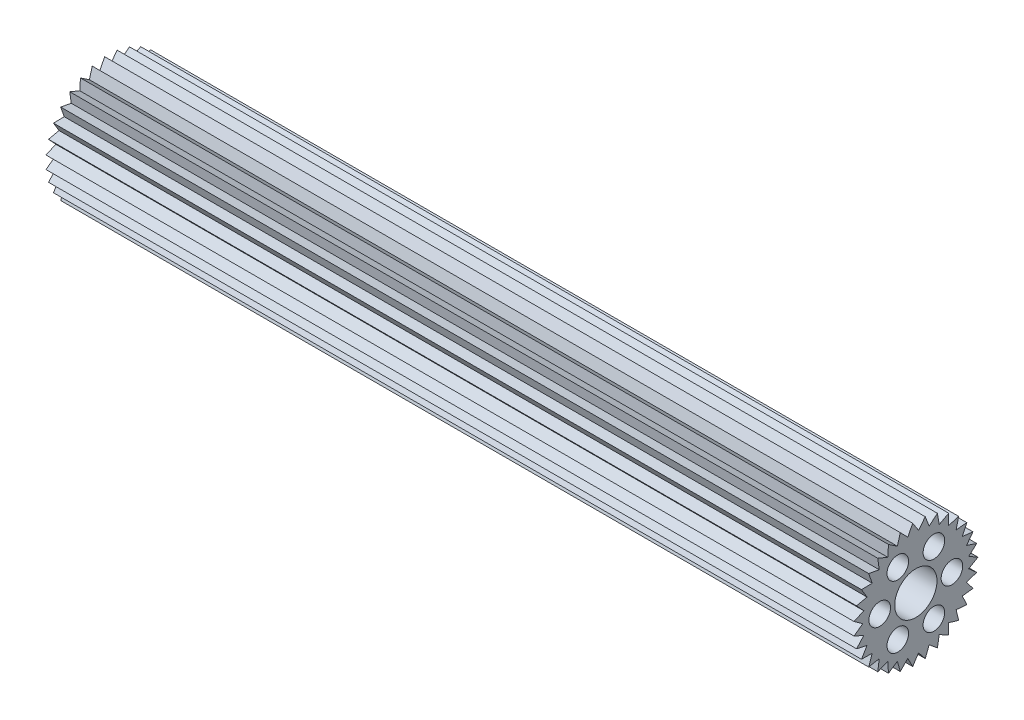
ISO-10303-21;
HEADER;
FILE_DESCRIPTION(('STEP AP214'),'2;1');
FILE_NAME('part.step','',(''),(''),'','','');
FILE_SCHEMA(('AUTOMOTIVE_DESIGN { 1 0 10303 214 1 1 1 1 }'));
ENDSEC;
DATA;
#1=APPLICATION_CONTEXT('core data for automotive mechanical design processes');
#2=APPLICATION_PROTOCOL_DEFINITION('international standard','automotive_design',2000,#1);
#3=PRODUCT_CONTEXT('',#1,'mechanical');
#4=PRODUCT('Part','Part','',(#3));
#5=PRODUCT_RELATED_PRODUCT_CATEGORY('part','',(#4));
#6=PRODUCT_DEFINITION_FORMATION('','',#4);
#7=PRODUCT_DEFINITION_CONTEXT('part definition',#1,'design');
#8=PRODUCT_DEFINITION('design','',#6,#7);
#9=PRODUCT_DEFINITION_SHAPE('','',#8);
#10=(LENGTH_UNIT() NAMED_UNIT(*) SI_UNIT(.MILLI.,.METRE.));
#11=(NAMED_UNIT(*) PLANE_ANGLE_UNIT() SI_UNIT($,.RADIAN.));
#12=(NAMED_UNIT(*) SI_UNIT($,.STERADIAN.) SOLID_ANGLE_UNIT());
#13=UNCERTAINTY_MEASURE_WITH_UNIT(LENGTH_MEASURE(1.E-05),#10,'distance_accuracy_value','');
#14=(GEOMETRIC_REPRESENTATION_CONTEXT(3) GLOBAL_UNCERTAINTY_ASSIGNED_CONTEXT((#13)) GLOBAL_UNIT_ASSIGNED_CONTEXT((#10,
#11,#12)) REPRESENTATION_CONTEXT('',''));
#15=CARTESIAN_POINT('',(0.,0.,0.));
#16=DIRECTION('',(0.,0.,1.));
#17=DIRECTION('',(1.,0.,0.));
#18=AXIS2_PLACEMENT_3D('',#15,#16,#17);
#19=CARTESIAN_POINT('',(234.,3.85916550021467,6.43092852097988));
#20=DIRECTION('',(0.,0.514555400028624,0.857457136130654));
#21=DIRECTION('',(0.,-0.857457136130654,0.514555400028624));
#22=AXIS2_PLACEMENT_3D('',#19,#20,#21);
#23=PLANE('',#22);
#24=DIRECTION('',(-1.,0.,0.));
#25=VECTOR('',#24,1.);
#26=CARTESIAN_POINT('',(234.,-7.27952943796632,13.1151992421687));
#27=LINE('',#26,#25);
#28=CARTESIAN_POINT('',(195.,-7.27952943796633,13.1151992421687));
#29=VERTEX_POINT('',#28);
#30=CARTESIAN_POINT('',(0.,-7.27952943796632,13.1151992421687));
#31=VERTEX_POINT('',#30);
#32=EDGE_CURVE('E973',#29,#31,#27,.T.);
#33=ORIENTED_EDGE('',*,*,#32,.F.);
#34=DIRECTION('',(0.,0.857457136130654,-0.514555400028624));
#35=VECTOR('',#34,1.);
#36=CARTESIAN_POINT('',(195.,3.85916550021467,6.43092852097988));
#37=LINE('',#36,#35);
#38=CARTESIAN_POINT('',(195.,-5.05542086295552,11.7805236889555));
#39=VERTEX_POINT('',#38);
#40=EDGE_CURVE('E1261',#29,#39,#37,.T.);
#41=ORIENTED_EDGE('',*,*,#40,.T.);
#42=DIRECTION('',(-1.,0.,0.));
#43=VECTOR('',#42,1.);
#44=CARTESIAN_POINT('',(234.,-5.05542086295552,11.7805236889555));
#45=LINE('',#44,#43);
#46=CARTESIAN_POINT('',(0.,-5.05542086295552,11.7805236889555));
#47=VERTEX_POINT('',#46);
#48=EDGE_CURVE('E974',#39,#47,#45,.T.);
#49=ORIENTED_EDGE('',*,*,#48,.T.);
#50=DIRECTION('',(0.,0.857457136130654,-0.514555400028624));
#51=VECTOR('',#50,1.);
#52=CARTESIAN_POINT('',(0.,3.85916550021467,6.43092852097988));
#53=LINE('',#52,#51);
#54=EDGE_CURVE('E964',#31,#47,#53,.T.);
#55=ORIENTED_EDGE('',*,*,#54,.F.);
#56=EDGE_LOOP('',(#33,#41,#49,#55));
#57=FACE_BOUND('',#56,.T.);
#58=ADVANCED_FACE('F417',(#57),#23,.T.);
#59=CARTESIAN_POINT('',(234.,-7.31992797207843,1.63360169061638));
#60=DIRECTION('',(0.,-0.975990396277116,0.217813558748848));
#61=DIRECTION('',(0.,-0.217813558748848,-0.975990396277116));
#62=AXIS2_PLACEMENT_3D('',#59,#60,#61);
#63=PLANE('',#62);
#64=ORIENTED_EDGE('',*,*,#48,.F.);
#65=DIRECTION('',(0.,0.217813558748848,0.975990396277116));
#66=VECTOR('',#65,1.);
#67=CARTESIAN_POINT('',(195.,-7.31992797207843,1.63360169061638));
#68=LINE('',#67,#66);
#69=CARTESIAN_POINT('',(195.,-4.49044684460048,14.3120888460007));
#70=VERTEX_POINT('',#69);
#71=EDGE_CURVE('E1256',#39,#70,#68,.T.);
#72=ORIENTED_EDGE('',*,*,#71,.T.);
#73=DIRECTION('',(-1.,0.,0.));
#74=VECTOR('',#73,1.);
#75=CARTESIAN_POINT('',(234.,-4.49044684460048,14.3120888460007));
#76=LINE('',#75,#74);
#77=CARTESIAN_POINT('',(0.,-4.49044684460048,14.3120888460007));
#78=VERTEX_POINT('',#77);
#79=EDGE_CURVE('E977',#70,#78,#76,.T.);
#80=ORIENTED_EDGE('',*,*,#79,.T.);
#81=DIRECTION('',(0.,0.217813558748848,0.975990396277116));
#82=VECTOR('',#81,1.);
#83=CARTESIAN_POINT('',(0.,-7.31992797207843,1.63360169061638));
#84=LINE('',#83,#82);
#85=EDGE_CURVE('E970',#47,#78,#84,.T.);
#86=ORIENTED_EDGE('',*,*,#85,.F.);
#87=EDGE_LOOP('',(#64,#72,#80,#86));
#88=FACE_BOUND('',#87,.T.);
#89=ADVANCED_FACE('F1366',(#88),#63,.T.);
#90=CARTESIAN_POINT('',(234.,6.22721094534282,-4.17993347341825));
#91=DIRECTION('',(0.,0.830294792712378,-0.557324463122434));
#92=DIRECTION('',(0.,0.557324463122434,0.830294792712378));
#93=AXIS2_PLACEMENT_3D('',#90,#91,#92);
#94=PLANE('',#93);
#95=DIRECTION('',(-1.,0.,0.));
#96=VECTOR('',#95,1.);
#97=CARTESIAN_POINT('',(234.,13.4670680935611,6.60591227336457));
#98=LINE('',#97,#96);
#99=CARTESIAN_POINT('',(195.,13.4670680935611,6.60591227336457));
#100=VERTEX_POINT('',#99);
#101=CARTESIAN_POINT('',(0.,13.4670680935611,6.60591227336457));
#102=VERTEX_POINT('',#101);
#103=EDGE_CURVE('E999',#100,#102,#98,.T.);
#104=ORIENTED_EDGE('',*,*,#103,.F.);
#105=DIRECTION('',(0.,-0.557324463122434,-0.830294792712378));
#106=VECTOR('',#105,1.);
#107=CARTESIAN_POINT('',(195.,6.22721094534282,-4.17993347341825));
#108=LINE('',#107,#106);
#109=CARTESIAN_POINT('',(195.,12.0214563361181,4.4522585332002));
#110=VERTEX_POINT('',#109);
#111=EDGE_CURVE('E1172',#100,#110,#108,.T.);
#112=ORIENTED_EDGE('',*,*,#111,.T.);
#113=DIRECTION('',(-1.,0.,0.));
#114=VECTOR('',#113,1.);
#115=CARTESIAN_POINT('',(234.,12.0214563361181,4.4522585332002));
#116=LINE('',#115,#114);
#117=CARTESIAN_POINT('',(0.,12.0214563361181,4.4522585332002));
#118=VERTEX_POINT('',#117);
#119=EDGE_CURVE('E1000',#110,#118,#116,.T.);
#120=ORIENTED_EDGE('',*,*,#119,.T.);
#121=DIRECTION('',(0.,-0.557324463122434,-0.830294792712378));
#122=VECTOR('',#121,1.);
#123=CARTESIAN_POINT('',(0.,6.22721094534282,-4.17993347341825));
#124=LINE('',#123,#122);
#125=EDGE_CURVE('E992',#102,#118,#124,.T.);
#126=ORIENTED_EDGE('',*,*,#125,.F.);
#127=EDGE_LOOP('',(#104,#112,#120,#126));
#128=FACE_BOUND('',#127,.T.);
#129=ADVANCED_FACE('F1373',(#128),#94,.T.);
#130=CARTESIAN_POINT('',(234.,2.00225324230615,7.22779232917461));
#131=DIRECTION('',(0.,0.266967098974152,0.963705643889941));
#132=DIRECTION('',(0.,-0.963705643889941,0.266967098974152));
#133=AXIS2_PLACEMENT_3D('',#130,#131,#132);
#134=PLANE('',#133);
#135=ORIENTED_EDGE('',*,*,#119,.F.);
#136=DIRECTION('',(0.,0.963705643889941,-0.266967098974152));
#137=VECTOR('',#136,1.);
#138=CARTESIAN_POINT('',(195.,2.00225324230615,7.22779232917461));
#139=LINE('',#138,#137);
#140=CARTESIAN_POINT('',(195.,14.521156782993,3.75978798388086));
#141=VERTEX_POINT('',#140);
#142=EDGE_CURVE('E1175',#110,#141,#139,.T.);
#143=ORIENTED_EDGE('',*,*,#142,.T.);
#144=DIRECTION('',(-1.,0.,0.));
#145=VECTOR('',#144,1.);
#146=CARTESIAN_POINT('',(234.,14.521156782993,3.75978798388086));
#147=LINE('',#146,#145);
#148=CARTESIAN_POINT('',(0.,14.521156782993,3.75978798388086));
#149=VERTEX_POINT('',#148);
#150=EDGE_CURVE('E1003',#141,#149,#147,.T.);
#151=ORIENTED_EDGE('',*,*,#150,.T.);
#152=DIRECTION('',(0.,0.963705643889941,-0.266967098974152));
#153=VECTOR('',#152,1.);
#154=CARTESIAN_POINT('',(0.,2.00225324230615,7.22779232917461));
#155=LINE('',#154,#153);
#156=EDGE_CURVE('E995',#118,#149,#155,.T.);
#157=ORIENTED_EDGE('',*,*,#156,.F.);
#158=EDGE_LOOP('',(#135,#143,#151,#157));
#159=FACE_BOUND('',#158,.T.);
#160=ADVANCED_FACE('F1389',(#159),#134,.T.);
#161=CARTESIAN_POINT('',(234.,-3.4162109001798,6.67678838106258));
#162=DIRECTION('',(0.,-0.455494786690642,0.890238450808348));
#163=DIRECTION('',(0.,-0.890238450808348,-0.455494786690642));
#164=AXIS2_PLACEMENT_3D('',#161,#162,#163);
#165=PLANE('',#164);
#166=DIRECTION('',(-1.,0.,0.));
#167=VECTOR('',#166,1.);
#168=CARTESIAN_POINT('',(234.,-14.9807476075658,0.759737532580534));
#169=LINE('',#168,#167);
#170=CARTESIAN_POINT('',(195.,-14.9807476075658,0.759737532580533));
#171=VERTEX_POINT('',#170);
#172=CARTESIAN_POINT('',(0.,-14.9807476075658,0.759737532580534));
#173=VERTEX_POINT('',#172);
#174=EDGE_CURVE('E1024',#171,#173,#169,.T.);
#175=ORIENTED_EDGE('',*,*,#174,.F.);
#176=DIRECTION('',(0.,0.890238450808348,0.455494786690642));
#177=VECTOR('',#176,1.);
#178=CARTESIAN_POINT('',(195.,-3.4162109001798,6.67678838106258));
#179=LINE('',#178,#177);
#180=CARTESIAN_POINT('',(195.,-12.6716094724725,1.94121916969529));
#181=VERTEX_POINT('',#180);
#182=EDGE_CURVE('E1324',#171,#181,#179,.T.);
#183=ORIENTED_EDGE('',*,*,#182,.T.);
#184=DIRECTION('',(-1.,0.,0.));
#185=VECTOR('',#184,1.);
#186=CARTESIAN_POINT('',(234.,-12.6716094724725,1.94121916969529));
#187=LINE('',#186,#185);
#188=CARTESIAN_POINT('',(0.,-12.6716094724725,1.94121916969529));
#189=VERTEX_POINT('',#188);
#190=EDGE_CURVE('E12',#181,#189,#187,.T.);
#191=ORIENTED_EDGE('',*,*,#190,.T.);
#192=DIRECTION('',(0.,0.890238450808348,0.455494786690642));
#193=VECTOR('',#192,1.);
#194=CARTESIAN_POINT('',(0.,-3.4162109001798,6.67678838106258));
#195=LINE('',#194,#193);
#196=EDGE_CURVE('E1018',#173,#189,#195,.T.);
#197=ORIENTED_EDGE('',*,*,#196,.F.);
#198=EDGE_LOOP('',(#175,#183,#191,#197));
#199=FACE_BOUND('',#198,.T.);
#200=ADVANCED_FACE('F1392',(#199),#165,.T.);
#201=CARTESIAN_POINT('',(234.,-5.25832514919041,-5.34789833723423));
#202=DIRECTION('',(0.,-0.701110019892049,-0.713053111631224));
#203=DIRECTION('',(0.,0.713053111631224,-0.701110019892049));
#204=AXIS2_PLACEMENT_3D('',#201,#202,#203);
#205=PLANE('',#204);
#206=ORIENTED_EDGE('',*,*,#190,.F.);
#207=DIRECTION('',(0.,-0.713053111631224,0.701110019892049));
#208=VECTOR('',#207,1.);
#209=CARTESIAN_POINT('',(195.,-5.25832514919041,-5.34789833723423));
#210=LINE('',#209,#208);
#211=CARTESIAN_POINT('',(195.,-14.5211567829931,3.75978798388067));
#212=VERTEX_POINT('',#211);
#213=EDGE_CURVE('E1327',#181,#212,#210,.T.);
#214=ORIENTED_EDGE('',*,*,#213,.T.);
#215=DIRECTION('',(-1.,0.,0.));
#216=VECTOR('',#215,1.);
#217=CARTESIAN_POINT('',(234.,-14.5211567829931,3.75978798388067));
#218=LINE('',#217,#216);
#219=CARTESIAN_POINT('',(0.,-14.5211567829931,3.75978798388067));
#220=VERTEX_POINT('',#219);
#221=EDGE_CURVE('E426',#212,#220,#218,.T.);
#222=ORIENTED_EDGE('',*,*,#221,.T.);
#223=DIRECTION('',(0.,-0.713053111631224,0.701110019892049));
#224=VECTOR('',#223,1.);
#225=CARTESIAN_POINT('',(0.,-5.25832514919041,-5.34789833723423));
#226=LINE('',#225,#224);
#227=EDGE_CURVE('E1021',#189,#220,#226,.T.);
#228=ORIENTED_EDGE('',*,*,#227,.F.);
#229=EDGE_LOOP('',(#206,#214,#222,#228));
#230=FACE_BOUND('',#229,.T.);
#231=ADVANCED_FACE('F1407',(#230),#205,.T.);
#232=CARTESIAN_POINT('',(234.,-5.77238428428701,4.78848406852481));
#233=DIRECTION('',(0.,-0.769651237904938,0.638464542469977));
#234=DIRECTION('',(0.,-0.638464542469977,-0.769651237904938));
#235=AXIS2_PLACEMENT_3D('',#232,#233,#234);
#236=PLANE('',#235);
#237=DIRECTION('',(-1.,0.,0.));
#238=VECTOR('',#237,1.);
#239=CARTESIAN_POINT('',(234.,-14.0662819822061,-5.20957879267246));
#240=LINE('',#239,#238);
#241=CARTESIAN_POINT('',(195.,-14.0662819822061,-5.20957879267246));
#242=VERTEX_POINT('',#241);
#243=CARTESIAN_POINT('',(0.,-14.0662819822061,-5.20957879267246));
#244=VERTEX_POINT('',#243);
#245=EDGE_CURVE('E1035',#242,#244,#240,.T.);
#246=ORIENTED_EDGE('',*,*,#245,.F.);
#247=DIRECTION('',(0.,0.638464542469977,0.769651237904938));
#248=VECTOR('',#247,1.);
#249=CARTESIAN_POINT('',(195.,-5.77238428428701,4.78848406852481));
#250=LINE('',#249,#248);
#251=CARTESIAN_POINT('',(195.,-12.4102056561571,-3.21322486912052));
#252=VERTEX_POINT('',#251);
#253=EDGE_CURVE('E1306',#242,#252,#250,.T.);
#254=ORIENTED_EDGE('',*,*,#253,.T.);
#255=DIRECTION('',(-1.,0.,0.));
#256=VECTOR('',#255,1.);
#257=CARTESIAN_POINT('',(234.,-12.4102056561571,-3.21322486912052));
#258=LINE('',#257,#256);
#259=CARTESIAN_POINT('',(0.,-12.4102056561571,-3.21322486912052));
#260=VERTEX_POINT('',#259);
#261=EDGE_CURVE('E1022',#252,#260,#258,.T.);
#262=ORIENTED_EDGE('',*,*,#261,.T.);
#263=DIRECTION('',(0.,0.638464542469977,0.769651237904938));
#264=VECTOR('',#263,1.);
#265=CARTESIAN_POINT('',(0.,-5.77238428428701,4.78848406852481));
#266=LINE('',#265,#264);
#267=EDGE_CURVE('E1028',#244,#260,#266,.T.);
#268=ORIENTED_EDGE('',*,*,#267,.F.);
#269=EDGE_LOOP('',(#246,#254,#262,#268));
#270=FACE_BOUND('',#269,.T.);
#271=ADVANCED_FACE('F1410',(#270),#236,.T.);
#272=CARTESIAN_POINT('',(234.,-2.72320395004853,-6.98814426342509));
#273=DIRECTION('',(0.,-0.363093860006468,-0.931752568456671));
#274=DIRECTION('',(0.,0.931752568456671,-0.363093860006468));
#275=AXIS2_PLACEMENT_3D('',#272,#273,#274);
#276=PLANE('',#275);
#277=ORIENTED_EDGE('',*,*,#261,.F.);
#278=DIRECTION('',(0.,-0.931752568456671,0.363093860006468));
#279=VECTOR('',#278,1.);
#280=CARTESIAN_POINT('',(195.,-2.72320395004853,-6.98814426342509));
#281=LINE('',#280,#279);
#282=CARTESIAN_POINT('',(195.,-14.8270248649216,-2.27141666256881));
#283=VERTEX_POINT('',#282);
#284=EDGE_CURVE('E1309',#252,#283,#281,.T.);
#285=ORIENTED_EDGE('',*,*,#284,.T.);
#286=DIRECTION('',(-1.,0.,0.));
#287=VECTOR('',#286,1.);
#288=CARTESIAN_POINT('',(234.,-14.8270248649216,-2.27141666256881));
#289=LINE('',#288,#287);
#290=CARTESIAN_POINT('',(0.,-14.8270248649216,-2.27141666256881));
#291=VERTEX_POINT('',#290);
#292=EDGE_CURVE('E1037',#283,#291,#289,.T.);
#293=ORIENTED_EDGE('',*,*,#292,.T.);
#294=DIRECTION('',(0.,-0.931752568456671,0.363093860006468));
#295=VECTOR('',#294,1.);
#296=CARTESIAN_POINT('',(0.,-2.72320395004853,-6.98814426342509));
#297=LINE('',#296,#295);
#298=EDGE_CURVE('E1031',#260,#291,#297,.T.);
#299=ORIENTED_EDGE('',*,*,#298,.F.);
#300=EDGE_LOOP('',(#277,#285,#293,#299));
#301=FACE_BOUND('',#300,.T.);
#302=ADVANCED_FACE('F1415',(#301),#276,.T.);
#303=CARTESIAN_POINT('',(234.,-7.192944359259,2.1240413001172));
#304=DIRECTION('',(0.,-0.959059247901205,0.283205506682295));
#305=DIRECTION('',(0.,-0.283205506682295,-0.959059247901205));
#306=AXIS2_PLACEMENT_3D('',#303,#304,#305);
#307=PLANE('',#306);
#308=DIRECTION('',(-1.,0.,0.));
#309=VECTOR('',#308,1.);
#310=CARTESIAN_POINT('',(234.,-10.8718918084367,-10.3345037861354));
#311=LINE('',#310,#309);
#312=CARTESIAN_POINT('',(195.,-10.8718918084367,-10.3345037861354));
#313=VERTEX_POINT('',#312);
#314=CARTESIAN_POINT('',(0.,-10.8718918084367,-10.3345037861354));
#315=VERTEX_POINT('',#314);
#316=EDGE_CURVE('E1047',#313,#315,#311,.T.);
#317=ORIENTED_EDGE('',*,*,#316,.F.);
#318=DIRECTION('',(0.,0.283205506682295,0.959059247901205));
#319=VECTOR('',#318,1.);
#320=CARTESIAN_POINT('',(195.,-7.192944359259,2.1240413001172));
#321=LINE('',#320,#319);
#322=CARTESIAN_POINT('',(195.,-10.1373013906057,-7.84685535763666));
#323=VERTEX_POINT('',#322);
#324=EDGE_CURVE('E1291',#313,#323,#321,.T.);
#325=ORIENTED_EDGE('',*,*,#324,.T.);
#326=DIRECTION('',(-1.,0.,0.));
#327=VECTOR('',#326,1.);
#328=CARTESIAN_POINT('',(234.,-10.1373013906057,-7.84685535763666));
#329=LINE('',#328,#327);
#330=CARTESIAN_POINT('',(0.,-10.1373013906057,-7.84685535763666));
#331=VERTEX_POINT('',#330);
#332=EDGE_CURVE('E1032',#323,#331,#329,.T.);
#333=ORIENTED_EDGE('',*,*,#332,.T.);
#334=DIRECTION('',(0.,0.283205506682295,0.959059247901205));
#335=VECTOR('',#334,1.);
#336=CARTESIAN_POINT('',(0.,-7.192944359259,2.1240413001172));
#337=LINE('',#336,#335);
#338=EDGE_CURVE('E1040',#315,#331,#337,.T.);
#339=ORIENTED_EDGE('',*,*,#338,.F.);
#340=EDGE_LOOP('',(#317,#325,#333,#339));
#341=FACE_BOUND('',#340,.T.);
#342=ADVANCED_FACE('F1418',(#341),#307,.T.);
#343=CARTESIAN_POINT('',(234.,0.253306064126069,-7.49572118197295));
#344=DIRECTION('',(0.,0.0337741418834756,-0.999429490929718));
#345=DIRECTION('',(0.,0.999429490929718,0.0337741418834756));
#346=AXIS2_PLACEMENT_3D('',#343,#344,#345);
#347=PLANE('',#346);
#348=ORIENTED_EDGE('',*,*,#332,.F.);
#349=DIRECTION('',(0.,-0.999429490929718,-0.0337741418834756));
#350=VECTOR('',#349,1.);
#351=CARTESIAN_POINT('',(195.,0.253306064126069,-7.49572118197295));
#352=LINE('',#351,#350);
#353=CARTESIAN_POINT('',(195.,-12.7296638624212,-7.93446015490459));
#354=VERTEX_POINT('',#353);
#355=EDGE_CURVE('E1294',#323,#354,#352,.T.);
#356=ORIENTED_EDGE('',*,*,#355,.T.);
#357=DIRECTION('',(-1.,0.,0.));
#358=VECTOR('',#357,1.);
#359=CARTESIAN_POINT('',(234.,-12.7296638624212,-7.93446015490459));
#360=LINE('',#359,#358);
#361=CARTESIAN_POINT('',(0.,-12.7296638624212,-7.93446015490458));
#362=VERTEX_POINT('',#361);
#363=EDGE_CURVE('E1049',#354,#362,#360,.T.);
#364=ORIENTED_EDGE('',*,*,#363,.T.);
#365=DIRECTION('',(0.,-0.999429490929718,-0.0337741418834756));
#366=VECTOR('',#365,1.);
#367=CARTESIAN_POINT('',(0.,0.253306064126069,-7.49572118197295));
#368=LINE('',#367,#366);
#369=EDGE_CURVE('E1043',#331,#362,#368,.T.);
#370=ORIENTED_EDGE('',*,*,#369,.F.);
#371=EDGE_LOOP('',(#348,#356,#364,#370));
#372=FACE_BOUND('',#371,.T.);
#373=ADVANCED_FACE('F1423',(#372),#347,.T.);
#374=CARTESIAN_POINT('',(234.,-7.44764053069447,-0.884675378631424));
#375=DIRECTION('',(0.,-0.993018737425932,-0.117956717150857));
#376=DIRECTION('',(0.,0.117956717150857,-0.993018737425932));
#377=AXIS2_PLACEMENT_3D('',#374,#375,#376);
#378=PLANE('',#377);
#379=DIRECTION('',(-1.,0.,0.));
#380=VECTOR('',#379,1.);
#381=CARTESIAN_POINT('',(234.,-5.9153378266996,-13.7843671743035));
#382=LINE('',#381,#380);
#383=CARTESIAN_POINT('',(195.,-5.9153378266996,-13.7843671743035));
#384=VERTEX_POINT('',#383);
#385=CARTESIAN_POINT('',(0.,-5.9153378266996,-13.7843671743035));
#386=VERTEX_POINT('',#385);
#387=EDGE_CURVE('E1059',#384,#386,#382,.T.);
#388=ORIENTED_EDGE('',*,*,#387,.F.);
#389=DIRECTION('',(0.,-0.117956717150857,0.993018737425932));
#390=VECTOR('',#389,1.);
#391=CARTESIAN_POINT('',(195.,-7.44764053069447,-0.884675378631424));
#392=LINE('',#391,#390);
#393=CARTESIAN_POINT('',(195.,-6.22129894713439,-11.208633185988));
#394=VERTEX_POINT('',#393);
#395=EDGE_CURVE('E1276',#384,#394,#392,.T.);
#396=ORIENTED_EDGE('',*,*,#395,.T.);
#397=DIRECTION('',(-1.,0.,0.));
#398=VECTOR('',#397,1.);
#399=CARTESIAN_POINT('',(234.,-6.22129894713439,-11.208633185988));
#400=LINE('',#399,#398);
#401=CARTESIAN_POINT('',(0.,-6.22129894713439,-11.208633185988));
#402=VERTEX_POINT('',#401);
#403=EDGE_CURVE('E1044',#394,#402,#400,.T.);
#404=ORIENTED_EDGE('',*,*,#403,.T.);
#405=DIRECTION('',(0.,-0.117956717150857,0.993018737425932));
#406=VECTOR('',#405,1.);
#407=CARTESIAN_POINT('',(0.,-7.44764053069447,-0.884675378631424));
#408=LINE('',#407,#406);
#409=EDGE_CURVE('E1052',#386,#402,#408,.T.);
#410=ORIENTED_EDGE('',*,*,#409,.F.);
#411=EDGE_LOOP('',(#388,#396,#404,#410));
#412=FACE_BOUND('',#411,.T.);
#413=ADVANCED_FACE('F1426',(#412),#378,.T.);
#414=CARTESIAN_POINT('',(234.,3.18875912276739,-6.78835880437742));
#415=DIRECTION('',(0.,0.425167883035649,-0.905114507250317));
#416=DIRECTION('',(0.,0.905114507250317,0.425167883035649));
#417=AXIS2_PLACEMENT_3D('',#414,#415,#416);
#418=PLANE('',#417);
#419=ORIENTED_EDGE('',*,*,#403,.F.);
#420=DIRECTION('',(0.,-0.905114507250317,-0.425167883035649));
#421=VECTOR('',#420,1.);
#422=CARTESIAN_POINT('',(195.,3.18875912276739,-6.78835880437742));
#423=LINE('',#422,#421);
#424=CARTESIAN_POINT('',(195.,-8.56902322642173,-12.3114516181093));
#425=VERTEX_POINT('',#424);
#426=EDGE_CURVE('E1279',#394,#425,#423,.T.);
#427=ORIENTED_EDGE('',*,*,#426,.T.);
#428=DIRECTION('',(-1.,0.,0.));
#429=VECTOR('',#428,1.);
#430=CARTESIAN_POINT('',(234.,-8.56902322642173,-12.3114516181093));
#431=LINE('',#430,#429);
#432=CARTESIAN_POINT('',(0.,-8.56902322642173,-12.3114516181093));
#433=VERTEX_POINT('',#432);
#434=EDGE_CURVE('E1061',#425,#433,#431,.T.);
#435=ORIENTED_EDGE('',*,*,#434,.T.);
#436=DIRECTION('',(0.,-0.905114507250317,-0.425167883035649));
#437=VECTOR('',#436,1.);
#438=CARTESIAN_POINT('',(0.,3.18875912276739,-6.78835880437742));
#439=LINE('',#438,#437);
#440=EDGE_CURVE('E1055',#402,#433,#439,.T.);
#441=ORIENTED_EDGE('',*,*,#440,.F.);
#442=EDGE_LOOP('',(#419,#427,#435,#441));
#443=FACE_BOUND('',#442,.T.);
#444=ADVANCED_FACE('F1431',(#443),#418,.T.);
#445=CARTESIAN_POINT('',(234.,5.60736414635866,-4.98070952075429));
#446=DIRECTION('',(0.,0.747648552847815,-0.664094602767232));
#447=DIRECTION('',(0.,0.664094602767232,0.747648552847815));
#448=AXIS2_PLACEMENT_3D('',#445,#446,#447);
#449=PLANE('',#448);
#450=DIRECTION('',(-1.,0.,0.));
#451=VECTOR('',#450,1.);
#452=CARTESIAN_POINT('',(234.,-1.29692114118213,-12.7536666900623));
#453=LINE('',#452,#451);
#454=CARTESIAN_POINT('',(195.,-1.29692114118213,-12.7536666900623));
#455=VERTEX_POINT('',#454);
#456=CARTESIAN_POINT('',(0.,-1.29692114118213,-12.7536666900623));
#457=VERTEX_POINT('',#456);
#458=EDGE_CURVE('E442',#455,#457,#453,.T.);
#459=ORIENTED_EDGE('',*,*,#458,.F.);
#460=DIRECTION('',(0.,-0.664094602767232,-0.747648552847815));
#461=VECTOR('',#460,1.);
#462=CARTESIAN_POINT('',(195.,5.60736414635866,-4.98070952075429));
#463=LINE('',#462,#461);
#464=CARTESIAN_POINT('',(195.,-3.0194778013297,-14.6929491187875));
#465=VERTEX_POINT('',#464);
#466=EDGE_CURVE('E1264',#455,#465,#463,.T.);
#467=ORIENTED_EDGE('',*,*,#466,.T.);
#468=DIRECTION('',(-1.,0.,0.));
#469=VECTOR('',#468,1.);
#470=CARTESIAN_POINT('',(234.,-3.0194778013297,-14.6929491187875));
#471=LINE('',#470,#469);
#472=CARTESIAN_POINT('',(0.,-3.0194778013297,-14.6929491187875));
#473=VERTEX_POINT('',#472);
#474=EDGE_CURVE('E1056',#465,#473,#471,.T.);
#475=ORIENTED_EDGE('',*,*,#474,.T.);
#476=DIRECTION('',(0.,-0.664094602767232,-0.747648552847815));
#477=VECTOR('',#476,1.);
#478=CARTESIAN_POINT('',(0.,5.60736414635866,-4.98070952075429));
#479=LINE('',#478,#477);
#480=EDGE_CURVE('E1064',#457,#473,#479,.T.);
#481=ORIENTED_EDGE('',*,*,#480,.F.);
#482=EDGE_LOOP('',(#459,#467,#475,#481));
#483=FACE_BOUND('',#482,.T.);
#484=ADVANCED_FACE('F1434',(#483),#449,.T.);
#485=CARTESIAN_POINT('',(234.,-6.49519052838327,-3.74999999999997));
#486=DIRECTION('',(0.,-0.86602540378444,-0.499999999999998));
#487=DIRECTION('',(0.,0.499999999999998,-0.86602540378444));
#488=AXIS2_PLACEMENT_3D('',#485,#486,#487);
#489=PLANE('',#488);
#490=DIRECTION('',(-1.,0.,0.));
#491=VECTOR('',#490,1.);
#492=CARTESIAN_POINT('',(234.,0.,-15.));
#493=LINE('',#492,#491);
#494=CARTESIAN_POINT('',(195.,0.,-15.));
#495=VERTEX_POINT('',#494);
#496=CARTESIAN_POINT('',(0.,0.,-15.));
#497=VERTEX_POINT('',#496);
#498=EDGE_CURVE('E1072',#495,#497,#493,.T.);
#499=ORIENTED_EDGE('',*,*,#498,.F.);
#500=DIRECTION('',(0.,-0.499999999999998,0.86602540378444));
#501=VECTOR('',#500,1.);
#502=CARTESIAN_POINT('',(195.,-6.49519052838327,-3.74999999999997));
#503=LINE('',#502,#501);
#504=EDGE_CURVE('E1259',#495,#455,#503,.T.);
#505=ORIENTED_EDGE('',*,*,#504,.T.);
#506=ORIENTED_EDGE('',*,*,#458,.T.);
#507=DIRECTION('',(0.,-0.499999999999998,0.86602540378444));
#508=VECTOR('',#507,1.);
#509=CARTESIAN_POINT('',(0.,-6.49519052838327,-3.74999999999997));
#510=LINE('',#509,#508);
#511=EDGE_CURVE('E1067',#497,#457,#510,.T.);
#512=ORIENTED_EDGE('',*,*,#511,.F.);
#513=EDGE_LOOP('',(#499,#505,#506,#512));
#514=FACE_BOUND('',#513,.T.);
#515=ADVANCED_FACE('F1439',(#514),#489,.T.);
#516=CARTESIAN_POINT('',(234.,-4.4899716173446,-6.00750820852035));
#517=DIRECTION('',(0.,-0.598662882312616,-0.801001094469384));
#518=DIRECTION('',(0.,0.801001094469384,-0.598662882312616));
#519=AXIS2_PLACEMENT_3D('',#516,#517,#518);
#520=PLANE('',#519);
#521=DIRECTION('',(-1.,0.,0.));
#522=VECTOR('',#521,1.);
#523=CARTESIAN_POINT('',(234.,5.91533782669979,-13.7843671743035));
#524=LINE('',#523,#522);
#525=CARTESIAN_POINT('',(195.,5.91533782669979,-13.7843671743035));
#526=VERTEX_POINT('',#525);
#527=CARTESIAN_POINT('',(0.,5.91533782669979,-13.7843671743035));
#528=VERTEX_POINT('',#527);
#529=EDGE_CURVE('E1082',#526,#528,#524,.T.);
#530=ORIENTED_EDGE('',*,*,#529,.F.);
#531=DIRECTION('',(0.,-0.801001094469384,0.598662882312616));
#532=VECTOR('',#531,1.);
#533=CARTESIAN_POINT('',(195.,-4.4899716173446,-6.00750820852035));
#534=LINE('',#533,#532);
#535=CARTESIAN_POINT('',(195.,3.83766731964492,-12.2315300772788));
#536=VERTEX_POINT('',#535);
#537=EDGE_CURVE('E1235',#526,#536,#534,.T.);
#538=ORIENTED_EDGE('',*,*,#537,.T.);
#539=DIRECTION('',(-1.,0.,0.));
#540=VECTOR('',#539,1.);
#541=CARTESIAN_POINT('',(234.,3.83766731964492,-12.2315300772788));
#542=LINE('',#541,#540);
#543=CARTESIAN_POINT('',(0.,3.83766731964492,-12.2315300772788));
#544=VERTEX_POINT('',#543);
#545=EDGE_CURVE('E1068',#536,#544,#542,.T.);
#546=ORIENTED_EDGE('',*,*,#545,.T.);
#547=DIRECTION('',(0.,-0.801001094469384,0.598662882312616));
#548=VECTOR('',#547,1.);
#549=CARTESIAN_POINT('',(0.,-4.4899716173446,-6.00750820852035));
#550=LINE('',#549,#548);
#551=EDGE_CURVE('E1075',#528,#544,#550,.T.);
#552=ORIENTED_EDGE('',*,*,#551,.F.);
#553=EDGE_LOOP('',(#530,#538,#546,#552));
#554=FACE_BOUND('',#553,.T.);
#555=ADVANCED_FACE('F1442',(#554),#520,.T.);
#556=CARTESIAN_POINT('',(234.,7.11710304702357,-2.36576503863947));
#557=DIRECTION('',(0.,0.948947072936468,-0.31543533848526));
#558=DIRECTION('',(0.,0.31543533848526,0.948947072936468));
#559=AXIS2_PLACEMENT_3D('',#556,#557,#558);
#560=PLANE('',#559);
#561=ORIENTED_EDGE('',*,*,#545,.F.);
#562=DIRECTION('',(0.,-0.31543533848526,-0.948947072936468));
#563=VECTOR('',#562,1.);
#564=CARTESIAN_POINT('',(195.,7.11710304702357,-2.36576503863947));
#565=LINE('',#564,#563);
#566=CARTESIAN_POINT('',(195.,3.0194778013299,-14.6929491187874));
#567=VERTEX_POINT('',#566);
#568=EDGE_CURVE('E1238',#536,#567,#565,.T.);
#569=ORIENTED_EDGE('',*,*,#568,.T.);
#570=DIRECTION('',(-1.,0.,0.));
#571=VECTOR('',#570,1.);
#572=CARTESIAN_POINT('',(234.,3.0194778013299,-14.6929491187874));
#573=LINE('',#572,#571);
#574=CARTESIAN_POINT('',(0.,3.0194778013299,-14.6929491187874));
#575=VERTEX_POINT('',#574);
#576=EDGE_CURVE('E1084',#567,#575,#573,.T.);
#577=ORIENTED_EDGE('',*,*,#576,.T.);
#578=DIRECTION('',(0.,-0.31543533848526,-0.948947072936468));
#579=VECTOR('',#578,1.);
#580=CARTESIAN_POINT('',(0.,7.11710304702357,-2.36576503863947));
#581=LINE('',#580,#579);
#582=EDGE_CURVE('E1078',#544,#575,#581,.T.);
#583=ORIENTED_EDGE('',*,*,#582,.F.);
#584=EDGE_LOOP('',(#561,#569,#577,#583));
#585=FACE_BOUND('',#584,.T.);
#586=ADVANCED_FACE('F1446',(#585),#560,.T.);
#587=CARTESIAN_POINT('',(234.,-1.75699845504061,-7.2912931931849));
#588=DIRECTION('',(0.,-0.234266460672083,-0.97217242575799));
#589=DIRECTION('',(0.,0.972172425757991,-0.234266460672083));
#590=AXIS2_PLACEMENT_3D('',#587,#588,#589);
#591=PLANE('',#590);
#592=DIRECTION('',(-1.,0.,0.));
#593=VECTOR('',#592,1.);
#594=CARTESIAN_POINT('',(234.,10.8718918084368,-10.3345037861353));
#595=LINE('',#594,#593);
#596=CARTESIAN_POINT('',(195.,10.8718918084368,-10.3345037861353));
#597=VERTEX_POINT('',#596);
#598=CARTESIAN_POINT('',(0.,10.8718918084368,-10.3345037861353));
#599=VERTEX_POINT('',#598);
#600=EDGE_CURVE('E1094',#597,#599,#595,.T.);
#601=ORIENTED_EDGE('',*,*,#600,.F.);
#602=DIRECTION('',(0.,-0.972172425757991,0.234266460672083));
#603=VECTOR('',#602,1.);
#604=CARTESIAN_POINT('',(195.,-1.75699845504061,-7.2912931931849));
#605=LINE('',#604,#603);
#606=CARTESIAN_POINT('',(195.,8.35022986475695,-9.72685353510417));
#607=VERTEX_POINT('',#606);
#608=EDGE_CURVE('E1220',#597,#607,#605,.T.);
#609=ORIENTED_EDGE('',*,*,#608,.T.);
#610=DIRECTION('',(-1.,0.,0.));
#611=VECTOR('',#610,1.);
#612=CARTESIAN_POINT('',(234.,8.35022986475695,-9.72685353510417));
#613=LINE('',#612,#611);
#614=CARTESIAN_POINT('',(0.,8.35022986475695,-9.72685353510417));
#615=VERTEX_POINT('',#614);
#616=EDGE_CURVE('E1079',#607,#615,#613,.T.);
#617=ORIENTED_EDGE('',*,*,#616,.T.);
#618=DIRECTION('',(0.,-0.972172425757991,0.234266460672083));
#619=VECTOR('',#618,1.);
#620=CARTESIAN_POINT('',(0.,-1.75699845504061,-7.2912931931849));
#621=LINE('',#620,#619);
#622=EDGE_CURVE('E1087',#599,#615,#621,.T.);
#623=ORIENTED_EDGE('',*,*,#622,.F.);
#624=EDGE_LOOP('',(#601,#609,#617,#623));
#625=FACE_BOUND('',#624,.T.);
#626=ADVANCED_FACE('F1449',(#625),#591,.T.);
#627=CARTESIAN_POINT('',(234.,7.47327073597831,0.632632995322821));
#628=DIRECTION('',(0.,0.996436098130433,0.0843510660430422));
#629=DIRECTION('',(0.,-0.0843510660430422,0.996436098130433));
#630=AXIS2_PLACEMENT_3D('',#627,#628,#629);
#631=PLANE('',#630);
#632=ORIENTED_EDGE('',*,*,#616,.F.);
#633=DIRECTION('',(0.,0.0843510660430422,-0.996436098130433));
#634=VECTOR('',#633,1.);
#635=CARTESIAN_POINT('',(195.,7.47327073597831,0.632632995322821));
#636=LINE('',#635,#634);
#637=CARTESIAN_POINT('',(195.,8.5690232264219,-12.3114516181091));
#638=VERTEX_POINT('',#637);
#639=EDGE_CURVE('E1223',#607,#638,#636,.T.);
#640=ORIENTED_EDGE('',*,*,#639,.T.);
#641=DIRECTION('',(-1.,0.,0.));
#642=VECTOR('',#641,1.);
#643=CARTESIAN_POINT('',(234.,8.5690232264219,-12.3114516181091));
#644=LINE('',#643,#642);
#645=CARTESIAN_POINT('',(0.,8.5690232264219,-12.3114516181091));
#646=VERTEX_POINT('',#645);
#647=EDGE_CURVE('E1096',#638,#646,#644,.T.);
#648=ORIENTED_EDGE('',*,*,#647,.T.);
#649=DIRECTION('',(0.,0.0843510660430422,-0.996436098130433));
#650=VECTOR('',#649,1.);
#651=CARTESIAN_POINT('',(0.,7.47327073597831,0.632632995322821));
#652=LINE('',#651,#650);
#653=EDGE_CURVE('E1090',#615,#646,#652,.T.);
#654=ORIENTED_EDGE('',*,*,#653,.F.);
#655=EDGE_LOOP('',(#632,#640,#648,#654));
#656=FACE_BOUND('',#655,.T.);
#657=ADVANCED_FACE('F1454',(#656),#631,.T.);
#658=CARTESIAN_POINT('',(234.,1.26075670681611,-7.393273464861));
#659=DIRECTION('',(0.,0.168100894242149,-0.985769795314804));
#660=DIRECTION('',(0.,0.985769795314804,0.168100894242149));
#661=AXIS2_PLACEMENT_3D('',#658,#659,#660);
#662=PLANE('',#661);
#663=DIRECTION('',(-1.,0.,0.));
#664=VECTOR('',#663,1.);
#665=CARTESIAN_POINT('',(234.,14.0662819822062,-5.20957879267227));
#666=LINE('',#665,#664);
#667=CARTESIAN_POINT('',(195.,14.0662819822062,-5.20957879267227));
#668=VERTEX_POINT('',#667);
#669=CARTESIAN_POINT('',(0.,14.0662819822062,-5.20957879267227));
#670=VERTEX_POINT('',#669);
#671=EDGE_CURVE('E1104',#668,#670,#666,.T.);
#672=ORIENTED_EDGE('',*,*,#671,.F.);
#673=DIRECTION('',(0.,-0.985769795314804,-0.168100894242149));
#674=VECTOR('',#673,1.);
#675=CARTESIAN_POINT('',(195.,1.26075670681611,-7.393273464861));
#676=LINE('',#675,#674);
#677=CARTESIAN_POINT('',(195.,11.509350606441,-5.64560599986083));
#678=VERTEX_POINT('',#677);
#679=EDGE_CURVE('E1205',#668,#678,#676,.T.);
#680=ORIENTED_EDGE('',*,*,#679,.T.);
#681=DIRECTION('',(-1.,0.,0.));
#682=VECTOR('',#681,1.);
#683=CARTESIAN_POINT('',(234.,11.509350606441,-5.64560599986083));
#684=LINE('',#683,#682);
#685=CARTESIAN_POINT('',(0.,11.509350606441,-5.64560599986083));
#686=VERTEX_POINT('',#685);
#687=EDGE_CURVE('E1091',#678,#686,#684,.T.);
#688=ORIENTED_EDGE('',*,*,#687,.T.);
#689=DIRECTION('',(0.,-0.985769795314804,-0.168100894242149));
#690=VECTOR('',#689,1.);
#691=CARTESIAN_POINT('',(0.,1.26075670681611,-7.393273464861));
#692=LINE('',#691,#690);
#693=EDGE_CURVE('E1014',#670,#686,#692,.T.);
#694=ORIENTED_EDGE('',*,*,#693,.F.);
#695=EDGE_LOOP('',(#672,#680,#688,#694));
#696=FACE_BOUND('',#695,.T.);
#697=ADVANCED_FACE('F1457',(#696),#662,.T.);
#698=CARTESIAN_POINT('',(234.,6.6181379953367,3.52849110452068));
#699=DIRECTION('',(0.,0.88241839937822,0.470465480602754));
#700=DIRECTION('',(0.,-0.470465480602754,0.88241839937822));
#701=AXIS2_PLACEMENT_3D('',#698,#699,#700);
#702=PLANE('',#701);
#703=ORIENTED_EDGE('',*,*,#687,.F.);
#704=DIRECTION('',(0.,0.470465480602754,-0.88241839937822));
#705=VECTOR('',#704,1.);
#706=CARTESIAN_POINT('',(195.,6.6181379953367,3.52849110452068));
#707=LINE('',#706,#705);
#708=CARTESIAN_POINT('',(195.,12.7296638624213,-7.93446015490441));
#709=VERTEX_POINT('',#708);
#710=EDGE_CURVE('E1208',#678,#709,#707,.T.);
#711=ORIENTED_EDGE('',*,*,#710,.T.);
#712=DIRECTION('',(-1.,0.,0.));
#713=VECTOR('',#712,1.);
#714=CARTESIAN_POINT('',(234.,12.7296638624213,-7.93446015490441));
#715=LINE('',#714,#713);
#716=CARTESIAN_POINT('',(0.,12.7296638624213,-7.93446015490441));
#717=VERTEX_POINT('',#716);
#718=EDGE_CURVE('E1106',#709,#717,#715,.T.);
#719=ORIENTED_EDGE('',*,*,#718,.T.);
#720=DIRECTION('',(0.,0.470465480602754,-0.88241839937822));
#721=VECTOR('',#720,1.);
#722=CARTESIAN_POINT('',(0.,6.6181379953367,3.52849110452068));
#723=LINE('',#722,#721);
#724=EDGE_CURVE('E1101',#686,#717,#723,.T.);
#725=ORIENTED_EDGE('',*,*,#724,.F.);
#726=EDGE_LOOP('',(#703,#711,#719,#725));
#727=FACE_BOUND('',#726,.T.);
#728=ADVANCED_FACE('F1405',(#727),#702,.T.);
#729=CARTESIAN_POINT('',(234.,4.07416290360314,-6.29691961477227));
#730=DIRECTION('',(0.,0.54322172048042,-0.839589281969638));
#731=DIRECTION('',(0.,0.839589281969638,0.54322172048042));
#732=AXIS2_PLACEMENT_3D('',#729,#730,#731);
#733=PLANE('',#732);
#734=DIRECTION('',(-1.,0.,0.));
#735=VECTOR('',#734,1.);
#736=CARTESIAN_POINT('',(234.,14.9807476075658,0.759737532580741));
#737=LINE('',#736,#735);
#738=CARTESIAN_POINT('',(195.,14.9807476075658,0.759737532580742));
#739=VERTEX_POINT('',#738);
#740=CARTESIAN_POINT('',(0.,14.9807476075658,0.759737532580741));
#741=VERTEX_POINT('',#740);
#742=EDGE_CURVE('E1011',#739,#741,#737,.T.);
#743=ORIENTED_EDGE('',*,*,#742,.F.);
#744=DIRECTION('',(0.,-0.839589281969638,-0.54322172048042));
#745=VECTOR('',#744,1.);
#746=CARTESIAN_POINT('',(195.,4.07416290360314,-6.29691961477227));
#747=LINE('',#746,#745);
#748=CARTESIAN_POINT('',(195.,12.802985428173,-0.649293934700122));
#749=VERTEX_POINT('',#748);
#750=EDGE_CURVE('E1187',#739,#749,#747,.T.);
#751=ORIENTED_EDGE('',*,*,#750,.T.);
#752=DIRECTION('',(-1.,0.,0.));
#753=VECTOR('',#752,1.);
#754=CARTESIAN_POINT('',(234.,12.802985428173,-0.649293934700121));
#755=LINE('',#754,#753);
#756=CARTESIAN_POINT('',(0.,12.802985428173,-0.649293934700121));
#757=VERTEX_POINT('',#756);
#758=EDGE_CURVE('E1012',#749,#757,#755,.T.);
#759=ORIENTED_EDGE('',*,*,#758,.T.);
#760=DIRECTION('',(0.,-0.839589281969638,-0.54322172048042));
#761=VECTOR('',#760,1.);
#762=CARTESIAN_POINT('',(0.,4.07416290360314,-6.29691961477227));
#763=LINE('',#762,#761);
#764=EDGE_CURVE('E1002',#741,#757,#763,.T.);
#765=ORIENTED_EDGE('',*,*,#764,.F.);
#766=EDGE_LOOP('',(#743,#751,#759,#765));
#767=FACE_BOUND('',#766,.T.);
#768=ADVANCED_FACE('F1401',(#767),#733,.T.);
#769=CARTESIAN_POINT('',(234.,4.69030848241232,5.85243593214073));
#770=DIRECTION('',(0.,0.625374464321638,0.780324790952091));
#771=DIRECTION('',(0.,-0.780324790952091,0.625374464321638));
#772=AXIS2_PLACEMENT_3D('',#769,#770,#771);
#773=PLANE('',#772);
#774=ORIENTED_EDGE('',*,*,#758,.F.);
#775=DIRECTION('',(0.,0.780324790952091,-0.625374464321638));
#776=VECTOR('',#775,1.);
#777=CARTESIAN_POINT('',(195.,4.69030848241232,5.85243593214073));
#778=LINE('',#777,#776);
#779=CARTESIAN_POINT('',(195.,14.8270248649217,-2.2714166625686));
#780=VERTEX_POINT('',#779);
#781=EDGE_CURVE('E1190',#749,#780,#778,.T.);
#782=ORIENTED_EDGE('',*,*,#781,.T.);
#783=DIRECTION('',(-1.,0.,0.));
#784=VECTOR('',#783,1.);
#785=CARTESIAN_POINT('',(234.,14.8270248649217,-2.2714166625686));
#786=LINE('',#785,#784);
#787=CARTESIAN_POINT('',(0.,14.8270248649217,-2.2714166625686));
#788=VERTEX_POINT('',#787);
#789=EDGE_CURVE('E1015',#780,#788,#786,.T.);
#790=ORIENTED_EDGE('',*,*,#789,.T.);
#791=DIRECTION('',(0.,0.780324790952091,-0.625374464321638));
#792=VECTOR('',#791,1.);
#793=CARTESIAN_POINT('',(0.,4.69030848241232,5.85243593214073));
#794=LINE('',#793,#792);
#795=EDGE_CURVE('E1008',#757,#788,#794,.T.);
#796=ORIENTED_EDGE('',*,*,#795,.F.);
#797=EDGE_LOOP('',(#774,#782,#790,#796));
#798=FACE_BOUND('',#797,.T.);
#799=ADVANCED_FACE('F1397',(#798),#773,.T.);
#800=CARTESIAN_POINT('',(234.,7.37092538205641,-1.38544542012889));
#801=DIRECTION('',(0.,0.982790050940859,-0.184726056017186));
#802=DIRECTION('',(0.,0.184726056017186,0.982790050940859));
#803=AXIS2_PLACEMENT_3D('',#800,#801,#802);
#804=PLANE('',#803);
#805=DIRECTION('',(-1.,0.,0.));
#806=VECTOR('',#805,1.);
#807=CARTESIAN_POINT('',(234.,9.77058724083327,11.3813718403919));
#808=LINE('',#807,#806);
#809=CARTESIAN_POINT('',(195.,9.77058724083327,11.3813718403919));
#810=VERTEX_POINT('',#809);
#811=CARTESIAN_POINT('',(0.,9.77058724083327,11.3813718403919));
#812=VERTEX_POINT('',#811);
#813=EDGE_CURVE('E1116',#810,#812,#808,.T.);
#814=ORIENTED_EDGE('',*,*,#813,.F.);
#815=DIRECTION('',(0.,-0.184726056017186,-0.982790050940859));
#816=VECTOR('',#815,1.);
#817=CARTESIAN_POINT('',(195.,7.37092538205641,-1.38544542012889));
#818=LINE('',#817,#816);
#819=CARTESIAN_POINT('',(195.,9.29143698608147,8.83216945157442));
#820=VERTEX_POINT('',#819);
#821=EDGE_CURVE('E1157',#810,#820,#818,.T.);
#822=ORIENTED_EDGE('',*,*,#821,.T.);
#823=DIRECTION('',(-1.,0.,0.));
#824=VECTOR('',#823,1.);
#825=CARTESIAN_POINT('',(234.,9.29143698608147,8.83216945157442));
#826=LINE('',#825,#824);
#827=CARTESIAN_POINT('',(0.,9.29143698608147,8.83216945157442));
#828=VERTEX_POINT('',#827);
#829=EDGE_CURVE('E996',#820,#828,#826,.T.);
#830=ORIENTED_EDGE('',*,*,#829,.T.);
#831=DIRECTION('',(0.,-0.184726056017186,-0.982790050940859));
#832=VECTOR('',#831,1.);
#833=CARTESIAN_POINT('',(0.,7.37092538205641,-1.38544542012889));
#834=LINE('',#833,#832);
#835=EDGE_CURVE('E1109',#812,#828,#834,.T.);
#836=ORIENTED_EDGE('',*,*,#835,.F.);
#837=EDGE_LOOP('',(#814,#822,#830,#836));
#838=FACE_BOUND('',#837,.T.);
#839=ADVANCED_FACE('F1400',(#838),#804,.T.);
#840=CARTESIAN_POINT('',(234.,-1.01033596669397,7.43163651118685));
#841=DIRECTION('',(0.,-0.134711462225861,0.990884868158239));
#842=DIRECTION('',(0.,-0.990884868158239,-0.134711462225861));
#843=AXIS2_PLACEMENT_3D('',#840,#841,#842);
#844=PLANE('',#843);
#845=ORIENTED_EDGE('',*,*,#829,.F.);
#846=DIRECTION('',(0.,0.990884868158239,0.134711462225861));
#847=VECTOR('',#846,1.);
#848=CARTESIAN_POINT('',(195.,-1.01033596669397,7.43163651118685));
#849=LINE('',#848,#847);
#850=CARTESIAN_POINT('',(195.,11.8616360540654,9.181589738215));
#851=VERTEX_POINT('',#850);
#852=EDGE_CURVE('E1160',#820,#851,#849,.T.);
#853=ORIENTED_EDGE('',*,*,#852,.T.);
#854=DIRECTION('',(-1.,0.,0.));
#855=VECTOR('',#854,1.);
#856=CARTESIAN_POINT('',(234.,11.8616360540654,9.181589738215));
#857=LINE('',#856,#855);
#858=CARTESIAN_POINT('',(0.,11.8616360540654,9.181589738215));
#859=VERTEX_POINT('',#858);
#860=EDGE_CURVE('E1118',#851,#859,#857,.T.);
#861=ORIENTED_EDGE('',*,*,#860,.T.);
#862=DIRECTION('',(0.,0.990884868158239,0.134711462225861));
#863=VECTOR('',#862,1.);
#864=CARTESIAN_POINT('',(0.,-1.01033596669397,7.43163651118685));
#865=LINE('',#864,#863);
#866=EDGE_CURVE('E1112',#828,#859,#865,.T.);
#867=ORIENTED_EDGE('',*,*,#866,.F.);
#868=EDGE_LOOP('',(#845,#853,#861,#867));
#869=FACE_BOUND('',#868,.T.);
#870=ADVANCED_FACE('F1468',(#869),#844,.T.);
#871=CARTESIAN_POINT('',(234.,7.31992797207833,1.63360169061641));
#872=DIRECTION('',(0.,0.975990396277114,0.217813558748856));
#873=DIRECTION('',(0.,-0.217813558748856,0.975990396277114));
#874=AXIS2_PLACEMENT_3D('',#871,#872,#873);
#875=PLANE('',#874);
#876=DIRECTION('',(-1.,0.,0.));
#877=VECTOR('',#876,1.);
#878=CARTESIAN_POINT('',(234.,4.49044684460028,14.3120888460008));
#879=LINE('',#878,#877);
#880=CARTESIAN_POINT('',(195.,4.49044684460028,14.3120888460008));
#881=VERTEX_POINT('',#880);
#882=CARTESIAN_POINT('',(0.,4.49044684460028,14.3120888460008));
#883=VERTEX_POINT('',#882);
#884=EDGE_CURVE('E1126',#881,#883,#879,.T.);
#885=ORIENTED_EDGE('',*,*,#884,.F.);
#886=DIRECTION('',(0.,0.217813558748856,-0.975990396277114));
#887=VECTOR('',#886,1.);
#888=CARTESIAN_POINT('',(195.,7.31992797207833,1.63360169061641));
#889=LINE('',#888,#887);
#890=CARTESIAN_POINT('',(195.,5.05542086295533,11.7805236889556));
#891=VERTEX_POINT('',#890);
#892=EDGE_CURVE('E1193',#881,#891,#889,.T.);
#893=ORIENTED_EDGE('',*,*,#892,.T.);
#894=DIRECTION('',(-1.,0.,0.));
#895=VECTOR('',#894,1.);
#896=CARTESIAN_POINT('',(234.,5.05542086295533,11.7805236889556));
#897=LINE('',#896,#895);
#898=CARTESIAN_POINT('',(0.,5.05542086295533,11.7805236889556));
#899=VERTEX_POINT('',#898);
#900=EDGE_CURVE('E1113',#891,#899,#897,.T.);
#901=ORIENTED_EDGE('',*,*,#900,.T.);
#902=DIRECTION('',(0.,0.217813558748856,-0.975990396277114));
#903=VECTOR('',#902,1.);
#904=CARTESIAN_POINT('',(0.,7.31992797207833,1.63360169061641));
#905=LINE('',#904,#903);
#906=EDGE_CURVE('E988',#883,#899,#905,.T.);
#907=ORIENTED_EDGE('',*,*,#906,.F.);
#908=EDGE_LOOP('',(#885,#893,#901,#907));
#909=FACE_BOUND('',#908,.T.);
#910=ADVANCED_FACE('F1471',(#909),#875,.T.);
#911=CARTESIAN_POINT('',(234.,-3.85916550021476,6.43092852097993));
#912=DIRECTION('',(0.,-0.51455540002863,0.85745713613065));
#913=DIRECTION('',(0.,-0.85745713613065,-0.51455540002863));
#914=AXIS2_PLACEMENT_3D('',#911,#912,#913);
#915=PLANE('',#914);
#916=ORIENTED_EDGE('',*,*,#900,.F.);
#917=DIRECTION('',(0.,0.85745713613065,0.51455540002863));
#918=VECTOR('',#917,1.);
#919=CARTESIAN_POINT('',(195.,-3.85916550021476,6.43092852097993));
#920=LINE('',#919,#918);
#921=CARTESIAN_POINT('',(195.,7.27952943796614,13.1151992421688));
#922=VERTEX_POINT('',#921);
#923=EDGE_CURVE('E1178',#891,#922,#920,.T.);
#924=ORIENTED_EDGE('',*,*,#923,.T.);
#925=DIRECTION('',(-1.,0.,0.));
#926=VECTOR('',#925,1.);
#927=CARTESIAN_POINT('',(234.,7.27952943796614,13.1151992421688));
#928=LINE('',#927,#926);
#929=CARTESIAN_POINT('',(0.,7.27952943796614,13.1151992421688));
#930=VERTEX_POINT('',#929);
#931=EDGE_CURVE('E1128',#922,#930,#928,.T.);
#932=ORIENTED_EDGE('',*,*,#931,.T.);
#933=DIRECTION('',(0.,0.85745713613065,0.51455540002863));
#934=VECTOR('',#933,1.);
#935=CARTESIAN_POINT('',(0.,-3.85916550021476,6.43092852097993));
#936=LINE('',#935,#934);
#937=EDGE_CURVE('E1123',#899,#930,#936,.T.);
#938=ORIENTED_EDGE('',*,*,#937,.F.);
#939=EDGE_LOOP('',(#916,#924,#932,#938));
#940=FACE_BOUND('',#939,.T.);
#941=ADVANCED_FACE('F1387',(#940),#915,.T.);
#942=CARTESIAN_POINT('',(234.,6.08248459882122,4.38786748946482));
#943=DIRECTION('',(0.,0.810997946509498,0.585048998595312));
#944=DIRECTION('',(0.,-0.585048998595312,0.810997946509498));
#945=AXIS2_PLACEMENT_3D('',#942,#943,#944);
#946=PLANE('',#945);
#947=DIRECTION('',(-1.,0.,0.));
#948=VECTOR('',#947,1.);
#949=CARTESIAN_POINT('',(234.,-1.51752482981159,14.9230398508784));
#950=LINE('',#949,#948);
#951=CARTESIAN_POINT('',(195.,-1.5175248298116,14.9230398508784));
#952=VERTEX_POINT('',#951);
#953=CARTESIAN_POINT('',(0.,-1.51752482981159,14.9230398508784));
#954=VERTEX_POINT('',#953);
#955=EDGE_CURVE('E985',#952,#954,#950,.T.);
#956=ORIENTED_EDGE('',*,*,#955,.F.);
#957=DIRECTION('',(0.,0.585048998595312,-0.810997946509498));
#958=VECTOR('',#957,1.);
#959=CARTESIAN_POINT('',(195.,6.08248459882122,4.38786748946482));
#960=LINE('',#959,#958);
#961=CARTESIAN_POINT('',(195.,0.,12.8194390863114));
#962=VERTEX_POINT('',#961);
#963=EDGE_CURVE('E1241',#952,#962,#960,.T.);
#964=ORIENTED_EDGE('',*,*,#963,.T.);
#965=DIRECTION('',(-1.,0.,0.));
#966=VECTOR('',#965,1.);
#967=CARTESIAN_POINT('',(234.,-1.02782365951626E-13,12.8194390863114));
#968=LINE('',#967,#966);
#969=CARTESIAN_POINT('',(0.,-1.02782365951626E-13,12.8194390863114));
#970=VERTEX_POINT('',#969);
#971=EDGE_CURVE('E986',#962,#970,#968,.T.);
#972=ORIENTED_EDGE('',*,*,#971,.T.);
#973=DIRECTION('',(0.,0.585048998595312,-0.810997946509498));
#974=VECTOR('',#973,1.);
#975=CARTESIAN_POINT('',(0.,6.08248459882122,4.38786748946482));
#976=LINE('',#975,#974);
#977=EDGE_CURVE('E976',#954,#970,#976,.T.);
#978=ORIENTED_EDGE('',*,*,#977,.F.);
#979=EDGE_LOOP('',(#956,#964,#972,#978));
#980=FACE_BOUND('',#979,.T.);
#981=ADVANCED_FACE('F1383',(#980),#946,.T.);
#982=CARTESIAN_POINT('',(234.,-6.08248459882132,4.38786748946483));
#983=DIRECTION('',(0.,-0.810997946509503,0.585048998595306));
#984=DIRECTION('',(0.,-0.585048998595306,-0.810997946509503));
#985=AXIS2_PLACEMENT_3D('',#982,#983,#984);
#986=PLANE('',#985);
#987=ORIENTED_EDGE('',*,*,#971,.F.);
#988=DIRECTION('',(0.,0.585048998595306,0.810997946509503));
#989=VECTOR('',#988,1.);
#990=CARTESIAN_POINT('',(195.,-6.08248459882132,4.38786748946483));
#991=LINE('',#990,#989);
#992=CARTESIAN_POINT('',(195.,1.51752482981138,14.9230398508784));
#993=VERTEX_POINT('',#992);
#994=EDGE_CURVE('E1226',#962,#993,#991,.T.);
#995=ORIENTED_EDGE('',*,*,#994,.T.);
#996=DIRECTION('',(-1.,0.,0.));
#997=VECTOR('',#996,1.);
#998=CARTESIAN_POINT('',(234.,1.51752482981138,14.9230398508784));
#999=LINE('',#998,#997);
#1000=CARTESIAN_POINT('',(0.,1.51752482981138,14.9230398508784));
#1001=VERTEX_POINT('',#1000);
#1002=EDGE_CURVE('E989',#993,#1001,#999,.T.);
#1003=ORIENTED_EDGE('',*,*,#1002,.T.);
#1004=DIRECTION('',(0.,0.585048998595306,0.810997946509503));
#1005=VECTOR('',#1004,1.);
#1006=CARTESIAN_POINT('',(0.,-6.08248459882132,4.38786748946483));
#1007=LINE('',#1006,#1005);
#1008=EDGE_CURVE('E982',#970,#1001,#1007,.T.);
#1009=ORIENTED_EDGE('',*,*,#1008,.F.);
#1010=EDGE_LOOP('',(#987,#995,#1003,#1009));
#1011=FACE_BOUND('',#1010,.T.);
#1012=ADVANCED_FACE('F1379',(#1011),#986,.T.);
#1013=CARTESIAN_POINT('',(234.,1.0103359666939,7.43163651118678));
#1014=DIRECTION('',(0.,0.134711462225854,0.99088486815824));
#1015=DIRECTION('',(0.,-0.99088486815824,0.134711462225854));
#1016=AXIS2_PLACEMENT_3D('',#1013,#1014,#1015);
#1017=PLANE('',#1016);
#1018=DIRECTION('',(-1.,0.,0.));
#1019=VECTOR('',#1018,1.);
#1020=CARTESIAN_POINT('',(234.,-11.8616360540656,9.18158973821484));
#1021=LINE('',#1020,#1019);
#1022=CARTESIAN_POINT('',(195.,-11.8616360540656,9.18158973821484));
#1023=VERTEX_POINT('',#1022);
#1024=CARTESIAN_POINT('',(0.,-11.8616360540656,9.18158973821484));
#1025=VERTEX_POINT('',#1024);
#1026=EDGE_CURVE('E961',#1023,#1025,#1021,.T.);
#1027=ORIENTED_EDGE('',*,*,#1026,.F.);
#1028=DIRECTION('',(0.,0.99088486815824,-0.134711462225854));
#1029=VECTOR('',#1028,1.);
#1030=CARTESIAN_POINT('',(195.,1.0103359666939,7.43163651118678));
#1031=LINE('',#1030,#1029);
#1032=CARTESIAN_POINT('',(195.,-9.29143698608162,8.83216945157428));
#1033=VERTEX_POINT('',#1032);
#1034=EDGE_CURVE('E1312',#1023,#1033,#1031,.T.);
#1035=ORIENTED_EDGE('',*,*,#1034,.T.);
#1036=DIRECTION('',(-1.,0.,0.));
#1037=VECTOR('',#1036,1.);
#1038=CARTESIAN_POINT('',(234.,-9.29143698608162,8.83216945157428));
#1039=LINE('',#1038,#1037);
#1040=CARTESIAN_POINT('',(0.,-9.29143698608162,8.83216945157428));
#1041=VERTEX_POINT('',#1040);
#1042=EDGE_CURVE('E962',#1033,#1041,#1039,.T.);
#1043=ORIENTED_EDGE('',*,*,#1042,.T.);
#1044=DIRECTION('',(0.,0.99088486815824,-0.134711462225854));
#1045=VECTOR('',#1044,1.);
#1046=CARTESIAN_POINT('',(0.,1.0103359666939,7.43163651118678));
#1047=LINE('',#1046,#1045);
#1048=EDGE_CURVE('E955',#1025,#1041,#1047,.T.);
#1049=ORIENTED_EDGE('',*,*,#1048,.F.);
#1050=EDGE_LOOP('',(#1027,#1035,#1043,#1049));
#1051=FACE_BOUND('',#1050,.T.);
#1052=ADVANCED_FACE('F1382',(#1051),#1017,.T.);
#1053=CARTESIAN_POINT('',(234.,-7.3709253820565,-1.38544542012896));
#1054=DIRECTION('',(0.,-0.982790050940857,-0.184726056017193));
#1055=DIRECTION('',(0.,0.184726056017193,-0.982790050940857));
#1056=AXIS2_PLACEMENT_3D('',#1053,#1054,#1055);
#1057=PLANE('',#1056);
#1058=ORIENTED_EDGE('',*,*,#1042,.F.);
#1059=DIRECTION('',(0.,-0.184726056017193,0.982790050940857));
#1060=VECTOR('',#1059,1.);
#1061=CARTESIAN_POINT('',(195.,-7.3709253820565,-1.38544542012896));
#1062=LINE('',#1061,#1060);
#1063=CARTESIAN_POINT('',(195.,-9.77058724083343,11.3813718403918));
#1064=VERTEX_POINT('',#1063);
#1065=EDGE_CURVE('E1297',#1033,#1064,#1062,.T.);
#1066=ORIENTED_EDGE('',*,*,#1065,.T.);
#1067=DIRECTION('',(-1.,0.,0.));
#1068=VECTOR('',#1067,1.);
#1069=CARTESIAN_POINT('',(234.,-9.77058724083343,11.3813718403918));
#1070=LINE('',#1069,#1068);
#1071=CARTESIAN_POINT('',(0.,-9.77058724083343,11.3813718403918));
#1072=VERTEX_POINT('',#1071);
#1073=EDGE_CURVE('E965',#1064,#1072,#1070,.T.);
#1074=ORIENTED_EDGE('',*,*,#1073,.T.);
#1075=DIRECTION('',(0.,-0.184726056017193,0.982790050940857));
#1076=VECTOR('',#1075,1.);
#1077=CARTESIAN_POINT('',(0.,-7.3709253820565,-1.38544542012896));
#1078=LINE('',#1077,#1076);
#1079=EDGE_CURVE('E958',#1041,#1072,#1078,.T.);
#1080=ORIENTED_EDGE('',*,*,#1079,.F.);
#1081=EDGE_LOOP('',(#1058,#1066,#1074,#1080));
#1082=FACE_BOUND('',#1081,.T.);
#1083=ADVANCED_FACE('F1518',(#1082),#1057,.T.);
#1084=CARTESIAN_POINT('',(234.,-4.69030848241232,5.85243593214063));
#1085=DIRECTION('',(0.,-0.625374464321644,0.780324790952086));
#1086=DIRECTION('',(0.,-0.780324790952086,-0.625374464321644));
#1087=AXIS2_PLACEMENT_3D('',#1084,#1085,#1086);
#1088=PLANE('',#1087);
#1089=ORIENTED_EDGE('',*,*,#292,.F.);
#1090=DIRECTION('',(0.,0.780324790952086,0.625374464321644));
#1091=VECTOR('',#1090,1.);
#1092=CARTESIAN_POINT('',(195.,-4.69030848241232,5.85243593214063));
#1093=LINE('',#1092,#1091);
#1094=CARTESIAN_POINT('',(195.,-12.8029854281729,-0.649293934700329));
#1095=VERTEX_POINT('',#1094);
#1096=EDGE_CURVE('E1315',#283,#1095,#1093,.T.);
#1097=ORIENTED_EDGE('',*,*,#1096,.T.);
#1098=DIRECTION('',(-1.,0.,0.));
#1099=VECTOR('',#1098,1.);
#1100=CARTESIAN_POINT('',(234.,-12.8029854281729,-0.649293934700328));
#1101=LINE('',#1100,#1099);
#1102=CARTESIAN_POINT('',(0.,-12.8029854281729,-0.649293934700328));
#1103=VERTEX_POINT('',#1102);
#1104=EDGE_CURVE('E953',#1095,#1103,#1101,.T.);
#1105=ORIENTED_EDGE('',*,*,#1104,.T.);
#1106=DIRECTION('',(0.,0.780324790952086,0.625374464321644));
#1107=VECTOR('',#1106,1.);
#1108=CARTESIAN_POINT('',(0.,-4.69030848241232,5.85243593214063));
#1109=LINE('',#1108,#1107);
#1110=EDGE_CURVE('E947',#291,#1103,#1109,.T.);
#1111=ORIENTED_EDGE('',*,*,#1110,.F.);
#1112=EDGE_LOOP('',(#1089,#1097,#1105,#1111));
#1113=FACE_BOUND('',#1112,.T.);
#1114=ADVANCED_FACE('F1633',(#1113),#1088,.T.);
#1115=CARTESIAN_POINT('',(234.,-4.07416290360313,-6.29691961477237));
#1116=DIRECTION('',(0.,-0.543221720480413,-0.839589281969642));
#1117=DIRECTION('',(0.,0.839589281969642,-0.543221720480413));
#1118=AXIS2_PLACEMENT_3D('',#1115,#1116,#1117);
#1119=PLANE('',#1118);
#1120=ORIENTED_EDGE('',*,*,#1104,.F.);
#1121=DIRECTION('',(0.,-0.839589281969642,0.543221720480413));
#1122=VECTOR('',#1121,1.);
#1123=CARTESIAN_POINT('',(195.,-4.07416290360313,-6.29691961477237));
#1124=LINE('',#1123,#1122);
#1125=EDGE_CURVE('E1318',#1095,#171,#1124,.T.);
#1126=ORIENTED_EDGE('',*,*,#1125,.T.);
#1127=ORIENTED_EDGE('',*,*,#174,.T.);
#1128=DIRECTION('',(0.,-0.839589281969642,0.543221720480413));
#1129=VECTOR('',#1128,1.);
#1130=CARTESIAN_POINT('',(0.,-4.07416290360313,-6.29691961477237));
#1131=LINE('',#1130,#1129);
#1132=EDGE_CURVE('E950',#1103,#173,#1131,.T.);
#1133=ORIENTED_EDGE('',*,*,#1132,.F.);
#1134=EDGE_LOOP('',(#1120,#1126,#1127,#1133));
#1135=FACE_BOUND('',#1134,.T.);
#1136=ADVANCED_FACE('F1629',(#1135),#1119,.T.);
#1137=CARTESIAN_POINT('',(234.,-6.61813799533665,3.52849110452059));
#1138=DIRECTION('',(0.,-0.882418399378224,0.470465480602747));
#1139=DIRECTION('',(0.,-0.470465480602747,-0.882418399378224));
#1140=AXIS2_PLACEMENT_3D('',#1137,#1138,#1139);
#1141=PLANE('',#1140);
#1142=ORIENTED_EDGE('',*,*,#363,.F.);
#1143=DIRECTION('',(0.,0.470465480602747,0.882418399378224));
#1144=VECTOR('',#1143,1.);
#1145=CARTESIAN_POINT('',(195.,-6.61813799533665,3.52849110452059));
#1146=LINE('',#1145,#1144);
#1147=CARTESIAN_POINT('',(195.,-11.5093506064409,-5.64560599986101));
#1148=VERTEX_POINT('',#1147);
#1149=EDGE_CURVE('E1300',#354,#1148,#1146,.T.);
#1150=ORIENTED_EDGE('',*,*,#1149,.T.);
#1151=DIRECTION('',(-1.,0.,0.));
#1152=VECTOR('',#1151,1.);
#1153=CARTESIAN_POINT('',(234.,-11.5093506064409,-5.64560599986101));
#1154=LINE('',#1153,#1152);
#1155=CARTESIAN_POINT('',(0.,-11.5093506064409,-5.64560599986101));
#1156=VERTEX_POINT('',#1155);
#1157=EDGE_CURVE('E945',#1148,#1156,#1154,.T.);
#1158=ORIENTED_EDGE('',*,*,#1157,.T.);
#1159=DIRECTION('',(0.,0.470465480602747,0.882418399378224));
#1160=VECTOR('',#1159,1.);
#1161=CARTESIAN_POINT('',(0.,-6.61813799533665,3.52849110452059));
#1162=LINE('',#1161,#1160);
#1163=EDGE_CURVE('E939',#362,#1156,#1162,.T.);
#1164=ORIENTED_EDGE('',*,*,#1163,.F.);
#1165=EDGE_LOOP('',(#1142,#1150,#1158,#1164));
#1166=FACE_BOUND('',#1165,.T.);
#1167=ADVANCED_FACE('F1625',(#1166),#1141,.T.);
#1168=CARTESIAN_POINT('',(234.,-1.26075670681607,-7.39327346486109));
#1169=DIRECTION('',(0.,-0.168100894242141,-0.985769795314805));
#1170=DIRECTION('',(0.,0.985769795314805,-0.168100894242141));
#1171=AXIS2_PLACEMENT_3D('',#1168,#1169,#1170);
#1172=PLANE('',#1171);
#1173=ORIENTED_EDGE('',*,*,#1157,.F.);
#1174=DIRECTION('',(0.,-0.985769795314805,0.168100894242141));
#1175=VECTOR('',#1174,1.);
#1176=CARTESIAN_POINT('',(195.,-1.26075670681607,-7.39327346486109));
#1177=LINE('',#1176,#1175);
#1178=EDGE_CURVE('E1303',#1148,#242,#1177,.T.);
#1179=ORIENTED_EDGE('',*,*,#1178,.T.);
#1180=ORIENTED_EDGE('',*,*,#245,.T.);
#1181=DIRECTION('',(0.,-0.985769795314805,0.168100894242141));
#1182=VECTOR('',#1181,1.);
#1183=CARTESIAN_POINT('',(0.,-1.26075670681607,-7.39327346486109));
#1184=LINE('',#1183,#1182);
#1185=EDGE_CURVE('E942',#1156,#244,#1184,.T.);
#1186=ORIENTED_EDGE('',*,*,#1185,.F.);
#1187=EDGE_LOOP('',(#1173,#1179,#1180,#1186));
#1188=FACE_BOUND('',#1187,.T.);
#1189=ADVANCED_FACE('F1621',(#1188),#1172,.T.);
#1190=CARTESIAN_POINT('',(234.,-7.47327073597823,0.632632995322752));
#1191=DIRECTION('',(0.,-0.996436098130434,0.0843510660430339));
#1192=DIRECTION('',(0.,-0.0843510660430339,-0.996436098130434));
#1193=AXIS2_PLACEMENT_3D('',#1190,#1191,#1192);
#1194=PLANE('',#1193);
#1195=ORIENTED_EDGE('',*,*,#434,.F.);
#1196=DIRECTION('',(0.,0.0843510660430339,0.996436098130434));
#1197=VECTOR('',#1196,1.);
#1198=CARTESIAN_POINT('',(195.,-7.47327073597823,0.632632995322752));
#1199=LINE('',#1198,#1197);
#1200=CARTESIAN_POINT('',(195.,-8.35022986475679,-9.7268535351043));
#1201=VERTEX_POINT('',#1200);
#1202=EDGE_CURVE('E1282',#425,#1201,#1199,.T.);
#1203=ORIENTED_EDGE('',*,*,#1202,.T.);
#1204=DIRECTION('',(-1.,0.,0.));
#1205=VECTOR('',#1204,1.);
#1206=CARTESIAN_POINT('',(234.,-8.35022986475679,-9.7268535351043));
#1207=LINE('',#1206,#1205);
#1208=CARTESIAN_POINT('',(0.,-8.35022986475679,-9.7268535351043));
#1209=VERTEX_POINT('',#1208);
#1210=EDGE_CURVE('E937',#1201,#1209,#1207,.T.);
#1211=ORIENTED_EDGE('',*,*,#1210,.T.);
#1212=DIRECTION('',(0.,0.0843510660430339,0.996436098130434));
#1213=VECTOR('',#1212,1.);
#1214=CARTESIAN_POINT('',(0.,-7.47327073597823,0.632632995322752));
#1215=LINE('',#1214,#1213);
#1216=EDGE_CURVE('E931',#433,#1209,#1215,.T.);
#1217=ORIENTED_EDGE('',*,*,#1216,.F.);
#1218=EDGE_LOOP('',(#1195,#1203,#1211,#1217));
#1219=FACE_BOUND('',#1218,.T.);
#1220=ADVANCED_FACE('F1617',(#1219),#1194,.T.);
#1221=CARTESIAN_POINT('',(234.,1.75699845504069,-7.29129319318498));
#1222=DIRECTION('',(0.,0.234266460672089,-0.972172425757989));
#1223=DIRECTION('',(0.,0.972172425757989,0.234266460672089));
#1224=AXIS2_PLACEMENT_3D('',#1221,#1222,#1223);
#1225=PLANE('',#1224);
#1226=ORIENTED_EDGE('',*,*,#1210,.F.);
#1227=DIRECTION('',(0.,-0.972172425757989,-0.234266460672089));
#1228=VECTOR('',#1227,1.);
#1229=CARTESIAN_POINT('',(195.,1.75699845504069,-7.29129319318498));
#1230=LINE('',#1229,#1228);
#1231=EDGE_CURVE('E1285',#1201,#313,#1230,.T.);
#1232=ORIENTED_EDGE('',*,*,#1231,.T.);
#1233=ORIENTED_EDGE('',*,*,#316,.T.);
#1234=DIRECTION('',(0.,-0.972172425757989,-0.234266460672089));
#1235=VECTOR('',#1234,1.);
#1236=CARTESIAN_POINT('',(0.,1.75699845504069,-7.29129319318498));
#1237=LINE('',#1236,#1235);
#1238=EDGE_CURVE('E934',#1209,#315,#1237,.T.);
#1239=ORIENTED_EDGE('',*,*,#1238,.F.);
#1240=EDGE_LOOP('',(#1226,#1232,#1233,#1239));
#1241=FACE_BOUND('',#1240,.T.);
#1242=ADVANCED_FACE('F1613',(#1241),#1225,.T.);
#1243=CARTESIAN_POINT('',(234.,-7.11710304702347,-2.36576503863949));
#1244=DIRECTION('',(0.,-0.948947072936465,-0.315435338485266));
#1245=DIRECTION('',(0.,0.315435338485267,-0.948947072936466));
#1246=AXIS2_PLACEMENT_3D('',#1243,#1244,#1245);
#1247=PLANE('',#1246);
#1248=ORIENTED_EDGE('',*,*,#474,.F.);
#1249=DIRECTION('',(0.,-0.315435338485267,0.948947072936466));
#1250=VECTOR('',#1249,1.);
#1251=CARTESIAN_POINT('',(195.,-7.11710304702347,-2.36576503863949));
#1252=LINE('',#1251,#1250);
#1253=CARTESIAN_POINT('',(195.,-3.83766731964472,-12.2315300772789));
#1254=VERTEX_POINT('',#1253);
#1255=EDGE_CURVE('E1267',#465,#1254,#1252,.T.);
#1256=ORIENTED_EDGE('',*,*,#1255,.T.);
#1257=DIRECTION('',(-1.,0.,0.));
#1258=VECTOR('',#1257,1.);
#1259=CARTESIAN_POINT('',(234.,-3.83766731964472,-12.2315300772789));
#1260=LINE('',#1259,#1258);
#1261=CARTESIAN_POINT('',(0.,-3.83766731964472,-12.2315300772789));
#1262=VERTEX_POINT('',#1261);
#1263=EDGE_CURVE('E929',#1254,#1262,#1260,.T.);
#1264=ORIENTED_EDGE('',*,*,#1263,.T.);
#1265=DIRECTION('',(0.,-0.315435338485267,0.948947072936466));
#1266=VECTOR('',#1265,1.);
#1267=CARTESIAN_POINT('',(0.,-7.11710304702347,-2.36576503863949));
#1268=LINE('',#1267,#1266);
#1269=EDGE_CURVE('E923',#473,#1262,#1268,.T.);
#1270=ORIENTED_EDGE('',*,*,#1269,.F.);
#1271=EDGE_LOOP('',(#1248,#1256,#1264,#1270));
#1272=FACE_BOUND('',#1271,.T.);
#1273=ADVANCED_FACE('F1609',(#1272),#1247,.T.);
#1274=CARTESIAN_POINT('',(234.,4.4899716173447,-6.0075082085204));
#1275=DIRECTION('',(0.,0.598662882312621,-0.80100109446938));
#1276=DIRECTION('',(0.,0.80100109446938,0.598662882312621));
#1277=AXIS2_PLACEMENT_3D('',#1274,#1275,#1276);
#1278=PLANE('',#1277);
#1279=ORIENTED_EDGE('',*,*,#1263,.F.);
#1280=DIRECTION('',(0.,-0.80100109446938,-0.598662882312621));
#1281=VECTOR('',#1280,1.);
#1282=CARTESIAN_POINT('',(195.,4.4899716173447,-6.0075082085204));
#1283=LINE('',#1282,#1281);
#1284=EDGE_CURVE('E1270',#1254,#384,#1283,.T.);
#1285=ORIENTED_EDGE('',*,*,#1284,.T.);
#1286=ORIENTED_EDGE('',*,*,#387,.T.);
#1287=DIRECTION('',(0.,-0.80100109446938,-0.598662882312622));
#1288=VECTOR('',#1287,1.);
#1289=CARTESIAN_POINT('',(0.,4.4899716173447,-6.0075082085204));
#1290=LINE('',#1289,#1288);
#1291=EDGE_CURVE('E926',#1262,#386,#1290,.T.);
#1292=ORIENTED_EDGE('',*,*,#1291,.F.);
#1293=EDGE_LOOP('',(#1279,#1285,#1286,#1292));
#1294=FACE_BOUND('',#1293,.T.);
#1295=ADVANCED_FACE('F1605',(#1294),#1278,.T.);
#1296=CARTESIAN_POINT('',(234.,6.49519052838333,-3.75000000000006));
#1297=DIRECTION('',(0.,0.866025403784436,-0.500000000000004));
#1298=DIRECTION('',(0.,0.500000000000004,0.866025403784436));
#1299=AXIS2_PLACEMENT_3D('',#1296,#1297,#1298);
#1300=PLANE('',#1299);
#1301=DIRECTION('',(-1.,0.,0.));
#1302=VECTOR('',#1301,1.);
#1303=CARTESIAN_POINT('',(234.,1.29692114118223,-12.7536666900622));
#1304=LINE('',#1303,#1302);
#1305=CARTESIAN_POINT('',(195.,1.29692114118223,-12.7536666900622));
#1306=VERTEX_POINT('',#1305);
#1307=CARTESIAN_POINT('',(0.,1.29692114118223,-12.7536666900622));
#1308=VERTEX_POINT('',#1307);
#1309=EDGE_CURVE('E921',#1306,#1308,#1304,.T.);
#1310=ORIENTED_EDGE('',*,*,#1309,.F.);
#1311=DIRECTION('',(0.,-0.500000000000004,-0.866025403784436));
#1312=VECTOR('',#1311,1.);
#1313=CARTESIAN_POINT('',(195.,6.49519052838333,-3.75000000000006));
#1314=LINE('',#1313,#1312);
#1315=EDGE_CURVE('E1250',#1306,#495,#1314,.T.);
#1316=ORIENTED_EDGE('',*,*,#1315,.T.);
#1317=ORIENTED_EDGE('',*,*,#498,.T.);
#1318=DIRECTION('',(0.,-0.500000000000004,-0.866025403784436));
#1319=VECTOR('',#1318,1.);
#1320=CARTESIAN_POINT('',(0.,6.49519052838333,-3.75000000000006));
#1321=LINE('',#1320,#1319);
#1322=EDGE_CURVE('E915',#1308,#497,#1321,.T.);
#1323=ORIENTED_EDGE('',*,*,#1322,.F.);
#1324=EDGE_LOOP('',(#1310,#1316,#1317,#1323));
#1325=FACE_BOUND('',#1324,.T.);
#1326=ADVANCED_FACE('F1601',(#1325),#1300,.T.);
#1327=CARTESIAN_POINT('',(234.,-5.60736414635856,-4.98070952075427));
#1328=DIRECTION('',(0.,-0.74764855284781,-0.664094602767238));
#1329=DIRECTION('',(0.,0.664094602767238,-0.74764855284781));
#1330=AXIS2_PLACEMENT_3D('',#1327,#1328,#1329);
#1331=PLANE('',#1330);
#1332=ORIENTED_EDGE('',*,*,#576,.F.);
#1333=DIRECTION('',(0.,-0.664094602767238,0.74764855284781));
#1334=VECTOR('',#1333,1.);
#1335=CARTESIAN_POINT('',(195.,-5.60736414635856,-4.98070952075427));
#1336=LINE('',#1335,#1334);
#1337=EDGE_CURVE('E1244',#567,#1306,#1336,.T.);
#1338=ORIENTED_EDGE('',*,*,#1337,.T.);
#1339=ORIENTED_EDGE('',*,*,#1309,.T.);
#1340=DIRECTION('',(0.,-0.664094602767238,0.74764855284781));
#1341=VECTOR('',#1340,1.);
#1342=CARTESIAN_POINT('',(0.,-5.60736414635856,-4.98070952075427));
#1343=LINE('',#1342,#1341);
#1344=EDGE_CURVE('E918',#575,#1308,#1343,.T.);
#1345=ORIENTED_EDGE('',*,*,#1344,.F.);
#1346=EDGE_LOOP('',(#1332,#1338,#1339,#1345));
#1347=FACE_BOUND('',#1346,.T.);
#1348=ADVANCED_FACE('F1597',(#1347),#1331,.T.);
#1349=CARTESIAN_POINT('',(234.,-3.1887591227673,-6.78835880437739));
#1350=DIRECTION('',(0.,-0.425167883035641,-0.905114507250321));
#1351=DIRECTION('',(0.,0.905114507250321,-0.425167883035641));
#1352=AXIS2_PLACEMENT_3D('',#1349,#1350,#1351);
#1353=PLANE('',#1352);
#1354=ORIENTED_EDGE('',*,*,#647,.F.);
#1355=DIRECTION('',(0.,-0.905114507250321,0.425167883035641));
#1356=VECTOR('',#1355,1.);
#1357=CARTESIAN_POINT('',(195.,-3.1887591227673,-6.78835880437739));
#1358=LINE('',#1357,#1356);
#1359=CARTESIAN_POINT('',(195.,6.22129894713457,-11.2086331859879));
#1360=VERTEX_POINT('',#1359);
#1361=EDGE_CURVE('E1229',#638,#1360,#1358,.T.);
#1362=ORIENTED_EDGE('',*,*,#1361,.T.);
#1363=DIRECTION('',(-1.,0.,0.));
#1364=VECTOR('',#1363,1.);
#1365=CARTESIAN_POINT('',(234.,6.22129894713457,-11.2086331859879));
#1366=LINE('',#1365,#1364);
#1367=CARTESIAN_POINT('',(0.,6.22129894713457,-11.2086331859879));
#1368=VERTEX_POINT('',#1367);
#1369=EDGE_CURVE('E913',#1360,#1368,#1366,.T.);
#1370=ORIENTED_EDGE('',*,*,#1369,.T.);
#1371=DIRECTION('',(0.,-0.905114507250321,0.425167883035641));
#1372=VECTOR('',#1371,1.);
#1373=CARTESIAN_POINT('',(0.,-3.1887591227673,-6.78835880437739));
#1374=LINE('',#1373,#1372);
#1375=EDGE_CURVE('E907',#646,#1368,#1374,.T.);
#1376=ORIENTED_EDGE('',*,*,#1375,.F.);
#1377=EDGE_LOOP('',(#1354,#1362,#1370,#1376));
#1378=FACE_BOUND('',#1377,.T.);
#1379=ADVANCED_FACE('F1593',(#1378),#1353,.T.);
#1380=CARTESIAN_POINT('',(234.,7.44764053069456,-0.88467537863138));
#1381=DIRECTION('',(0.,0.993018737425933,-0.11795671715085));
#1382=DIRECTION('',(0.,0.11795671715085,0.993018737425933));
#1383=AXIS2_PLACEMENT_3D('',#1380,#1381,#1382);
#1384=PLANE('',#1383);
#1385=ORIENTED_EDGE('',*,*,#1369,.F.);
#1386=DIRECTION('',(0.,-0.11795671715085,-0.993018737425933));
#1387=VECTOR('',#1386,1.);
#1388=CARTESIAN_POINT('',(195.,7.44764053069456,-0.88467537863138));
#1389=LINE('',#1388,#1387);
#1390=EDGE_CURVE('E1232',#1360,#526,#1389,.T.);
#1391=ORIENTED_EDGE('',*,*,#1390,.T.);
#1392=ORIENTED_EDGE('',*,*,#529,.T.);
#1393=DIRECTION('',(0.,-0.11795671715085,-0.993018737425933));
#1394=VECTOR('',#1393,1.);
#1395=CARTESIAN_POINT('',(0.,7.44764053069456,-0.88467537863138));
#1396=LINE('',#1395,#1394);
#1397=EDGE_CURVE('E910',#1368,#528,#1396,.T.);
#1398=ORIENTED_EDGE('',*,*,#1397,.F.);
#1399=EDGE_LOOP('',(#1385,#1391,#1392,#1398));
#1400=FACE_BOUND('',#1399,.T.);
#1401=ADVANCED_FACE('F1589',(#1400),#1384,.T.);
#1402=CARTESIAN_POINT('',(234.,-0.25330606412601,-7.49572118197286));
#1403=DIRECTION('',(0.,-0.0337741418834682,-0.999429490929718));
#1404=DIRECTION('',(0.,0.999429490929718,-0.0337741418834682));
#1405=AXIS2_PLACEMENT_3D('',#1402,#1403,#1404);
#1406=PLANE('',#1405);
#1407=ORIENTED_EDGE('',*,*,#718,.F.);
#1408=DIRECTION('',(0.,-0.999429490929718,0.0337741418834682));
#1409=VECTOR('',#1408,1.);
#1410=CARTESIAN_POINT('',(195.,-0.25330606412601,-7.49572118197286));
#1411=LINE('',#1410,#1409);
#1412=CARTESIAN_POINT('',(195.,10.1373013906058,-7.8468553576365));
#1413=VERTEX_POINT('',#1412);
#1414=EDGE_CURVE('E1211',#709,#1413,#1411,.T.);
#1415=ORIENTED_EDGE('',*,*,#1414,.T.);
#1416=DIRECTION('',(-1.,0.,0.));
#1417=VECTOR('',#1416,1.);
#1418=CARTESIAN_POINT('',(234.,10.1373013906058,-7.8468553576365));
#1419=LINE('',#1418,#1417);
#1420=CARTESIAN_POINT('',(0.,10.1373013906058,-7.8468553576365));
#1421=VERTEX_POINT('',#1420);
#1422=EDGE_CURVE('E905',#1413,#1421,#1419,.T.);
#1423=ORIENTED_EDGE('',*,*,#1422,.T.);
#1424=DIRECTION('',(0.,-0.999429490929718,0.0337741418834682));
#1425=VECTOR('',#1424,1.);
#1426=CARTESIAN_POINT('',(0.,-0.25330606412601,-7.49572118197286));
#1427=LINE('',#1426,#1425);
#1428=EDGE_CURVE('E899',#717,#1421,#1427,.T.);
#1429=ORIENTED_EDGE('',*,*,#1428,.F.);
#1430=EDGE_LOOP('',(#1407,#1415,#1423,#1429));
#1431=FACE_BOUND('',#1430,.T.);
#1432=ADVANCED_FACE('F1585',(#1431),#1406,.T.);
#1433=CARTESIAN_POINT('',(234.,7.19294435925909,2.12404130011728));
#1434=DIRECTION('',(0.,0.959059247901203,0.283205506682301));
#1435=DIRECTION('',(0.,-0.283205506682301,0.959059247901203));
#1436=AXIS2_PLACEMENT_3D('',#1433,#1434,#1435);
#1437=PLANE('',#1436);
#1438=ORIENTED_EDGE('',*,*,#1422,.F.);
#1439=DIRECTION('',(0.,0.283205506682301,-0.959059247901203));
#1440=VECTOR('',#1439,1.);
#1441=CARTESIAN_POINT('',(195.,7.19294435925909,2.12404130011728));
#1442=LINE('',#1441,#1440);
#1443=EDGE_CURVE('E1214',#1413,#597,#1442,.T.);
#1444=ORIENTED_EDGE('',*,*,#1443,.T.);
#1445=ORIENTED_EDGE('',*,*,#600,.T.);
#1446=DIRECTION('',(0.,0.283205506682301,-0.959059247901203));
#1447=VECTOR('',#1446,1.);
#1448=CARTESIAN_POINT('',(0.,7.19294435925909,2.12404130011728));
#1449=LINE('',#1448,#1447);
#1450=EDGE_CURVE('E902',#1421,#599,#1449,.T.);
#1451=ORIENTED_EDGE('',*,*,#1450,.F.);
#1452=EDGE_LOOP('',(#1438,#1444,#1445,#1451));
#1453=FACE_BOUND('',#1452,.T.);
#1454=ADVANCED_FACE('F1581',(#1453),#1437,.T.);
#1455=CARTESIAN_POINT('',(234.,2.72320395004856,-6.98814426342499));
#1456=DIRECTION('',(0.,0.363093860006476,-0.931752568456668));
#1457=DIRECTION('',(0.,0.931752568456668,0.363093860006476));
#1458=AXIS2_PLACEMENT_3D('',#1455,#1456,#1457);
#1459=PLANE('',#1458);
#1460=ORIENTED_EDGE('',*,*,#789,.F.);
#1461=DIRECTION('',(0.,-0.931752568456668,-0.363093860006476));
#1462=VECTOR('',#1461,1.);
#1463=CARTESIAN_POINT('',(195.,2.72320395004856,-6.98814426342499));
#1464=LINE('',#1463,#1462);
#1465=CARTESIAN_POINT('',(195.,12.4102056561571,-3.21322486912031));
#1466=VERTEX_POINT('',#1465);
#1467=EDGE_CURVE('E1196',#780,#1466,#1464,.T.);
#1468=ORIENTED_EDGE('',*,*,#1467,.T.);
#1469=DIRECTION('',(-1.,0.,0.));
#1470=VECTOR('',#1469,1.);
#1471=CARTESIAN_POINT('',(234.,12.4102056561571,-3.21322486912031));
#1472=LINE('',#1471,#1470);
#1473=CARTESIAN_POINT('',(0.,12.4102056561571,-3.21322486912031));
#1474=VERTEX_POINT('',#1473);
#1475=EDGE_CURVE('E897',#1466,#1474,#1472,.T.);
#1476=ORIENTED_EDGE('',*,*,#1475,.T.);
#1477=DIRECTION('',(0.,-0.931752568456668,-0.363093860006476));
#1478=VECTOR('',#1477,1.);
#1479=CARTESIAN_POINT('',(0.,2.72320395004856,-6.98814426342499));
#1480=LINE('',#1479,#1478);
#1481=EDGE_CURVE('E891',#788,#1474,#1480,.T.);
#1482=ORIENTED_EDGE('',*,*,#1481,.F.);
#1483=EDGE_LOOP('',(#1460,#1468,#1476,#1482));
#1484=FACE_BOUND('',#1483,.T.);
#1485=ADVANCED_FACE('F1577',(#1484),#1459,.T.);
#1486=CARTESIAN_POINT('',(234.,5.77238428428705,4.78848406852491));
#1487=DIRECTION('',(0.,0.769651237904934,0.638464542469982));
#1488=DIRECTION('',(0.,-0.638464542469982,0.769651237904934));
#1489=AXIS2_PLACEMENT_3D('',#1486,#1487,#1488);
#1490=PLANE('',#1489);
#1491=ORIENTED_EDGE('',*,*,#1475,.F.);
#1492=DIRECTION('',(0.,0.638464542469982,-0.769651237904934));
#1493=VECTOR('',#1492,1.);
#1494=CARTESIAN_POINT('',(195.,5.77238428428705,4.78848406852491));
#1495=LINE('',#1494,#1493);
#1496=EDGE_CURVE('E1199',#1466,#668,#1495,.T.);
#1497=ORIENTED_EDGE('',*,*,#1496,.T.);
#1498=ORIENTED_EDGE('',*,*,#671,.T.);
#1499=DIRECTION('',(0.,0.638464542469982,-0.769651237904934));
#1500=VECTOR('',#1499,1.);
#1501=CARTESIAN_POINT('',(0.,5.77238428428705,4.78848406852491));
#1502=LINE('',#1501,#1500);
#1503=EDGE_CURVE('E894',#1474,#670,#1502,.T.);
#1504=ORIENTED_EDGE('',*,*,#1503,.F.);
#1505=EDGE_LOOP('',(#1491,#1497,#1498,#1504));
#1506=FACE_BOUND('',#1505,.T.);
#1507=ADVANCED_FACE('F1573',(#1506),#1490,.T.);
#1508=CARTESIAN_POINT('',(234.,5.25832514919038,-5.34789833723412));
#1509=DIRECTION('',(0.,0.701110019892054,-0.713053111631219));
#1510=DIRECTION('',(0.,0.713053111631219,0.701110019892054));
#1511=AXIS2_PLACEMENT_3D('',#1508,#1509,#1510);
#1512=PLANE('',#1511);
#1513=ORIENTED_EDGE('',*,*,#150,.F.);
#1514=DIRECTION('',(0.,-0.713053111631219,-0.701110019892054));
#1515=VECTOR('',#1514,1.);
#1516=CARTESIAN_POINT('',(195.,5.25832514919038,-5.34789833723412));
#1517=LINE('',#1516,#1515);
#1518=CARTESIAN_POINT('',(195.,12.6716094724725,1.94121916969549));
#1519=VERTEX_POINT('',#1518);
#1520=EDGE_CURVE('E1181',#141,#1519,#1517,.T.);
#1521=ORIENTED_EDGE('',*,*,#1520,.T.);
#1522=DIRECTION('',(-1.,0.,0.));
#1523=VECTOR('',#1522,1.);
#1524=CARTESIAN_POINT('',(234.,12.6716094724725,1.94121916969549));
#1525=LINE('',#1524,#1523);
#1526=CARTESIAN_POINT('',(0.,12.6716094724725,1.94121916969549));
#1527=VERTEX_POINT('',#1526);
#1528=EDGE_CURVE('E889',#1519,#1527,#1525,.T.);
#1529=ORIENTED_EDGE('',*,*,#1528,.T.);
#1530=DIRECTION('',(0.,-0.713053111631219,-0.701110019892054));
#1531=VECTOR('',#1530,1.);
#1532=CARTESIAN_POINT('',(0.,5.25832514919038,-5.34789833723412));
#1533=LINE('',#1532,#1531);
#1534=EDGE_CURVE('E883',#149,#1527,#1533,.T.);
#1535=ORIENTED_EDGE('',*,*,#1534,.F.);
#1536=EDGE_LOOP('',(#1513,#1521,#1529,#1535));
#1537=FACE_BOUND('',#1536,.T.);
#1538=ADVANCED_FACE('F1569',(#1537),#1512,.T.);
#1539=CARTESIAN_POINT('',(234.,3.41621090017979,6.67678838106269));
#1540=DIRECTION('',(0.,0.455494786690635,0.890238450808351));
#1541=DIRECTION('',(0.,-0.890238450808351,0.455494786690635));
#1542=AXIS2_PLACEMENT_3D('',#1539,#1540,#1541);
#1543=PLANE('',#1542);
#1544=ORIENTED_EDGE('',*,*,#1528,.F.);
#1545=DIRECTION('',(0.,0.890238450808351,-0.455494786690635));
#1546=VECTOR('',#1545,1.);
#1547=CARTESIAN_POINT('',(195.,3.41621090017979,6.67678838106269));
#1548=LINE('',#1547,#1546);
#1549=EDGE_CURVE('E1184',#1519,#739,#1548,.T.);
#1550=ORIENTED_EDGE('',*,*,#1549,.T.);
#1551=ORIENTED_EDGE('',*,*,#742,.T.);
#1552=DIRECTION('',(0.,0.890238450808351,-0.455494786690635));
#1553=VECTOR('',#1552,1.);
#1554=CARTESIAN_POINT('',(0.,3.41621090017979,6.67678838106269));
#1555=LINE('',#1554,#1553);
#1556=EDGE_CURVE('E886',#1527,#741,#1555,.T.);
#1557=ORIENTED_EDGE('',*,*,#1556,.F.);
#1558=EDGE_LOOP('',(#1544,#1550,#1551,#1557));
#1559=FACE_BOUND('',#1558,.T.);
#1560=ADVANCED_FACE('F1565',(#1559),#1543,.T.);
#1561=CARTESIAN_POINT('',(234.,6.94115399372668,-2.84084164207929));
#1562=DIRECTION('',(0.,0.925487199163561,-0.378778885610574));
#1563=DIRECTION('',(0.,0.378778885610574,0.925487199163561));
#1564=AXIS2_PLACEMENT_3D('',#1561,#1562,#1563);
#1565=PLANE('',#1564);
#1566=ORIENTED_EDGE('',*,*,#860,.F.);
#1567=DIRECTION('',(0.,-0.378778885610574,-0.925487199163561));
#1568=VECTOR('',#1567,1.);
#1569=CARTESIAN_POINT('',(195.,6.94115399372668,-2.84084164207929));
#1570=LINE('',#1569,#1568);
#1571=CARTESIAN_POINT('',(195.,10.8791433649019,6.78102190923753));
#1572=VERTEX_POINT('',#1571);
#1573=EDGE_CURVE('E1163',#851,#1572,#1570,.T.);
#1574=ORIENTED_EDGE('',*,*,#1573,.T.);
#1575=DIRECTION('',(-1.,0.,0.));
#1576=VECTOR('',#1575,1.);
#1577=CARTESIAN_POINT('',(234.,10.8791433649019,6.78102190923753));
#1578=LINE('',#1577,#1576);
#1579=CARTESIAN_POINT('',(0.,10.8791433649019,6.78102190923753));
#1580=VERTEX_POINT('',#1579);
#1581=EDGE_CURVE('E881',#1572,#1580,#1578,.T.);
#1582=ORIENTED_EDGE('',*,*,#1581,.T.);
#1583=DIRECTION('',(0.,-0.378778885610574,-0.925487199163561));
#1584=VECTOR('',#1583,1.);
#1585=CARTESIAN_POINT('',(0.,6.94115399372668,-2.84084164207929));
#1586=LINE('',#1585,#1584);
#1587=EDGE_CURVE('E875',#859,#1580,#1586,.T.);
#1588=ORIENTED_EDGE('',*,*,#1587,.F.);
#1589=EDGE_LOOP('',(#1566,#1574,#1582,#1588));
#1590=FACE_BOUND('',#1589,.T.);
#1591=ADVANCED_FACE('F1561',(#1590),#1565,.T.);
#1592=CARTESIAN_POINT('',(234.,0.506323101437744,7.48288961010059));
#1593=DIRECTION('',(0.,0.0675097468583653,0.997718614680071));
#1594=DIRECTION('',(0.,-0.997718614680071,0.0675097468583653));
#1595=AXIS2_PLACEMENT_3D('',#1592,#1593,#1594);
#1596=PLANE('',#1595);
#1597=ORIENTED_EDGE('',*,*,#1581,.F.);
#1598=DIRECTION('',(0.,0.997718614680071,-0.0675097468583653));
#1599=VECTOR('',#1598,1.);
#1600=CARTESIAN_POINT('',(195.,0.506323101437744,7.48288961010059));
#1601=LINE('',#1600,#1599);
#1602=EDGE_CURVE('E1166',#1572,#100,#1601,.T.);
#1603=ORIENTED_EDGE('',*,*,#1602,.T.);
#1604=ORIENTED_EDGE('',*,*,#103,.T.);
#1605=DIRECTION('',(0.,0.997718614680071,-0.0675097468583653));
#1606=VECTOR('',#1605,1.);
#1607=CARTESIAN_POINT('',(0.,0.506323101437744,7.48288961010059));
#1608=LINE('',#1607,#1606);
#1609=EDGE_CURVE('E878',#1580,#102,#1608,.T.);
#1610=ORIENTED_EDGE('',*,*,#1609,.F.);
#1611=EDGE_LOOP('',(#1597,#1603,#1604,#1610));
#1612=FACE_BOUND('',#1611,.T.);
#1613=ADVANCED_FACE('F1557',(#1612),#1596,.T.);
#1614=CARTESIAN_POINT('',(234.,7.4989302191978,0.12667110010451));
#1615=DIRECTION('',(0.,0.99985736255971,0.0168894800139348));
#1616=DIRECTION('',(0.,-0.0168894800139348,0.99985736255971));
#1617=AXIS2_PLACEMENT_3D('',#1614,#1615,#1616);
#1618=PLANE('',#1617);
#1619=ORIENTED_EDGE('',*,*,#931,.F.);
#1620=DIRECTION('',(0.,0.0168894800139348,-0.99985736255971));
#1621=VECTOR('',#1620,1.);
#1622=CARTESIAN_POINT('',(195.,7.4989302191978,0.12667110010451));
#1623=LINE('',#1622,#1621);
#1624=CARTESIAN_POINT('',(195.,7.32333808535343,10.521726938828));
#1625=VERTEX_POINT('',#1624);
#1626=EDGE_CURVE('E1169',#922,#1625,#1623,.T.);
#1627=ORIENTED_EDGE('',*,*,#1626,.T.);
#1628=DIRECTION('',(-1.,0.,0.));
#1629=VECTOR('',#1628,1.);
#1630=CARTESIAN_POINT('',(234.,7.32333808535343,10.521726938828));
#1631=LINE('',#1630,#1629);
#1632=CARTESIAN_POINT('',(0.,7.32333808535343,10.521726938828));
#1633=VERTEX_POINT('',#1632);
#1634=EDGE_CURVE('E873',#1625,#1633,#1631,.T.);
#1635=ORIENTED_EDGE('',*,*,#1634,.T.);
#1636=DIRECTION('',(0.,0.0168894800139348,-0.99985736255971));
#1637=VECTOR('',#1636,1.);
#1638=CARTESIAN_POINT('',(0.,7.4989302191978,0.12667110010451));
#1639=LINE('',#1638,#1637);
#1640=EDGE_CURVE('E867',#930,#1633,#1639,.T.);
#1641=ORIENTED_EDGE('',*,*,#1640,.F.);
#1642=EDGE_LOOP('',(#1619,#1627,#1635,#1641));
#1643=FACE_BOUND('',#1642,.T.);
#1644=ADVANCED_FACE('F1553',(#1643),#1618,.T.);
#1645=CARTESIAN_POINT('',(234.,-2.4856317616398,7.07613134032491));
#1646=DIRECTION('',(0.,-0.331417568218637,0.94348417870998));
#1647=DIRECTION('',(0.,-0.94348417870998,-0.331417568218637));
#1648=AXIS2_PLACEMENT_3D('',#1645,#1646,#1647);
#1649=PLANE('',#1648);
#1650=ORIENTED_EDGE('',*,*,#1634,.F.);
#1651=DIRECTION('',(0.,0.94348417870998,0.331417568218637));
#1652=VECTOR('',#1651,1.);
#1653=CARTESIAN_POINT('',(195.,-2.4856317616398,7.07613134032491));
#1654=LINE('',#1653,#1652);
#1655=EDGE_CURVE('E1135',#1625,#810,#1654,.T.);
#1656=ORIENTED_EDGE('',*,*,#1655,.T.);
#1657=ORIENTED_EDGE('',*,*,#813,.T.);
#1658=DIRECTION('',(0.,0.94348417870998,0.331417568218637));
#1659=VECTOR('',#1658,1.);
#1660=CARTESIAN_POINT('',(0.,-2.4856317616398,7.07613134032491));
#1661=LINE('',#1660,#1659);
#1662=EDGE_CURVE('E870',#1633,#812,#1661,.T.);
#1663=ORIENTED_EDGE('',*,*,#1662,.F.);
#1664=EDGE_LOOP('',(#1650,#1656,#1657,#1663));
#1665=FACE_BOUND('',#1664,.T.);
#1666=ADVANCED_FACE('F1550',(#1665),#1649,.T.);
#1667=CARTESIAN_POINT('',(234.,6.84124701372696,3.07365243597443));
#1668=DIRECTION('',(0.,0.912166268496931,0.409820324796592));
#1669=DIRECTION('',(0.,-0.409820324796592,0.912166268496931));
#1670=AXIS2_PLACEMENT_3D('',#1667,#1668,#1669);
#1671=PLANE('',#1670);
#1672=ORIENTED_EDGE('',*,*,#1002,.F.);
#1673=DIRECTION('',(0.,0.409820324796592,-0.912166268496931));
#1674=VECTOR('',#1673,1.);
#1675=CARTESIAN_POINT('',(195.,6.84124701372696,3.07365243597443));
#1676=LINE('',#1675,#1674);
#1677=CARTESIAN_POINT('',(195.,2.5805341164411,12.5570244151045));
#1678=VERTEX_POINT('',#1677);
#1679=EDGE_CURVE('E1217',#993,#1678,#1676,.T.);
#1680=ORIENTED_EDGE('',*,*,#1679,.T.);
#1681=DIRECTION('',(-1.,0.,0.));
#1682=VECTOR('',#1681,1.);
#1683=CARTESIAN_POINT('',(234.,2.5805341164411,12.5570244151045));
#1684=LINE('',#1683,#1682);
#1685=CARTESIAN_POINT('',(0.,2.5805341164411,12.5570244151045));
#1686=VERTEX_POINT('',#1685);
#1687=EDGE_CURVE('E865',#1678,#1686,#1684,.T.);
#1688=ORIENTED_EDGE('',*,*,#1687,.T.);
#1689=DIRECTION('',(0.,0.409820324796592,-0.912166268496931));
#1690=VECTOR('',#1689,1.);
#1691=CARTESIAN_POINT('',(0.,6.84124701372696,3.07365243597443));
#1692=LINE('',#1691,#1690);
#1693=EDGE_CURVE('E859',#1001,#1686,#1692,.T.);
#1694=ORIENTED_EDGE('',*,*,#1693,.F.);
#1695=EDGE_LOOP('',(#1672,#1680,#1688,#1694));
#1696=FACE_BOUND('',#1695,.T.);
#1697=ADVANCED_FACE('F1493',(#1696),#1671,.T.);
#1698=CARTESIAN_POINT('',(234.,-5.07470454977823,5.52244273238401));
#1699=DIRECTION('',(0.,-0.676627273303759,0.736325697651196));
#1700=DIRECTION('',(0.,-0.736325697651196,-0.676627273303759));
#1701=AXIS2_PLACEMENT_3D('',#1698,#1699,#1700);
#1702=PLANE('',#1701);
#1703=ORIENTED_EDGE('',*,*,#1687,.F.);
#1704=DIRECTION('',(0.,0.736325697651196,0.676627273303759));
#1705=VECTOR('',#1704,1.);
#1706=CARTESIAN_POINT('',(195.,-5.07470454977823,5.52244273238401));
#1707=LINE('',#1706,#1705);
#1708=EDGE_CURVE('E1202',#1678,#881,#1707,.T.);
#1709=ORIENTED_EDGE('',*,*,#1708,.T.);
#1710=ORIENTED_EDGE('',*,*,#884,.T.);
#1711=DIRECTION('',(0.,0.736325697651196,0.676627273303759));
#1712=VECTOR('',#1711,1.);
#1713=CARTESIAN_POINT('',(0.,-5.07470454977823,5.52244273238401));
#1714=LINE('',#1713,#1712);
#1715=EDGE_CURVE('E862',#1686,#883,#1714,.T.);
#1716=ORIENTED_EDGE('',*,*,#1715,.F.);
#1717=EDGE_LOOP('',(#1703,#1709,#1710,#1716));
#1718=FACE_BOUND('',#1717,.T.);
#1719=ADVANCED_FACE('F1488',(#1718),#1702,.T.);
#1720=CARTESIAN_POINT('',(234.,5.07470454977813,5.52244273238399));
#1721=DIRECTION('',(0.,0.676627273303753,0.736325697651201));
#1722=DIRECTION('',(0.,-0.736325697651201,0.676627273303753));
#1723=AXIS2_PLACEMENT_3D('',#1720,#1721,#1722);
#1724=PLANE('',#1723);
#1725=ORIENTED_EDGE('',*,*,#79,.F.);
#1726=DIRECTION('',(0.,0.736325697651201,-0.676627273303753));
#1727=VECTOR('',#1726,1.);
#1728=CARTESIAN_POINT('',(195.,5.07470454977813,5.52244273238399));
#1729=LINE('',#1728,#1727);
#1730=CARTESIAN_POINT('',(195.,-2.58053411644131,12.5570244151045));
#1731=VERTEX_POINT('',#1730);
#1732=EDGE_CURVE('E1253',#70,#1731,#1729,.T.);
#1733=ORIENTED_EDGE('',*,*,#1732,.T.);
#1734=DIRECTION('',(-1.,0.,0.));
#1735=VECTOR('',#1734,1.);
#1736=CARTESIAN_POINT('',(234.,-2.58053411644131,12.5570244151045));
#1737=LINE('',#1736,#1735);
#1738=CARTESIAN_POINT('',(0.,-2.58053411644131,12.5570244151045));
#1739=VERTEX_POINT('',#1738);
#1740=EDGE_CURVE('E857',#1731,#1739,#1737,.T.);
#1741=ORIENTED_EDGE('',*,*,#1740,.T.);
#1742=DIRECTION('',(0.,0.736325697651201,-0.676627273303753));
#1743=VECTOR('',#1742,1.);
#1744=CARTESIAN_POINT('',(0.,5.07470454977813,5.52244273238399));
#1745=LINE('',#1744,#1743);
#1746=EDGE_CURVE('E851',#78,#1739,#1745,.T.);
#1747=ORIENTED_EDGE('',*,*,#1746,.F.);
#1748=EDGE_LOOP('',(#1725,#1733,#1741,#1747));
#1749=FACE_BOUND('',#1748,.T.);
#1750=ADVANCED_FACE('F1504',(#1749),#1724,.T.);
#1751=CARTESIAN_POINT('',(234.,-6.84124701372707,3.07365243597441));
#1752=DIRECTION('',(0.,-0.912166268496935,0.409820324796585));
#1753=DIRECTION('',(0.,-0.409820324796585,-0.912166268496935));
#1754=AXIS2_PLACEMENT_3D('',#1751,#1752,#1753);
#1755=PLANE('',#1754);
#1756=ORIENTED_EDGE('',*,*,#1740,.F.);
#1757=DIRECTION('',(0.,0.409820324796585,0.912166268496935));
#1758=VECTOR('',#1757,1.);
#1759=CARTESIAN_POINT('',(195.,-6.84124701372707,3.07365243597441));
#1760=LINE('',#1759,#1758);
#1761=EDGE_CURVE('E1247',#1731,#952,#1760,.T.);
#1762=ORIENTED_EDGE('',*,*,#1761,.T.);
#1763=ORIENTED_EDGE('',*,*,#955,.T.);
#1764=DIRECTION('',(0.,0.409820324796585,0.912166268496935));
#1765=VECTOR('',#1764,1.);
#1766=CARTESIAN_POINT('',(0.,-6.84124701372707,3.07365243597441));
#1767=LINE('',#1766,#1765);
#1768=EDGE_CURVE('E854',#1739,#954,#1767,.T.);
#1769=ORIENTED_EDGE('',*,*,#1768,.F.);
#1770=EDGE_LOOP('',(#1756,#1762,#1763,#1769));
#1771=FACE_BOUND('',#1770,.T.);
#1772=ADVANCED_FACE('F1499',(#1771),#1755,.T.);
#1773=CARTESIAN_POINT('',(234.,2.48563176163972,7.07613134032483));
#1774=DIRECTION('',(0.,0.33141756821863,0.943484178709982));
#1775=DIRECTION('',(0.,-0.943484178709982,0.33141756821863));
#1776=AXIS2_PLACEMENT_3D('',#1773,#1774,#1775);
#1777=PLANE('',#1776);
#1778=ORIENTED_EDGE('',*,*,#1073,.F.);
#1779=DIRECTION('',(0.,0.943484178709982,-0.33141756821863));
#1780=VECTOR('',#1779,1.);
#1781=CARTESIAN_POINT('',(195.,2.48563176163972,7.07613134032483));
#1782=LINE('',#1781,#1780);
#1783=CARTESIAN_POINT('',(195.,-7.3233380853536,10.5217269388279));
#1784=VERTEX_POINT('',#1783);
#1785=EDGE_CURVE('E1288',#1064,#1784,#1782,.T.);
#1786=ORIENTED_EDGE('',*,*,#1785,.T.);
#1787=DIRECTION('',(-1.,0.,0.));
#1788=VECTOR('',#1787,1.);
#1789=CARTESIAN_POINT('',(234.,-7.3233380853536,10.5217269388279));
#1790=LINE('',#1789,#1788);
#1791=CARTESIAN_POINT('',(0.,-7.3233380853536,10.5217269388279));
#1792=VERTEX_POINT('',#1791);
#1793=EDGE_CURVE('E849',#1784,#1792,#1790,.T.);
#1794=ORIENTED_EDGE('',*,*,#1793,.T.);
#1795=DIRECTION('',(0.,0.943484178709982,-0.33141756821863));
#1796=VECTOR('',#1795,1.);
#1797=CARTESIAN_POINT('',(0.,2.48563176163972,7.07613134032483));
#1798=LINE('',#1797,#1796);
#1799=EDGE_CURVE('E842',#1072,#1792,#1798,.T.);
#1800=ORIENTED_EDGE('',*,*,#1799,.F.);
#1801=EDGE_LOOP('',(#1778,#1786,#1794,#1800));
#1802=FACE_BOUND('',#1801,.T.);
#1803=ADVANCED_FACE('F1515',(#1802),#1777,.T.);
#1804=CARTESIAN_POINT('',(234.,-7.49893021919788,0.126671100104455));
#1805=DIRECTION('',(0.,-0.99985736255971,0.0168894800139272));
#1806=DIRECTION('',(0.,-0.0168894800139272,-0.99985736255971));
#1807=AXIS2_PLACEMENT_3D('',#1804,#1805,#1806);
#1808=PLANE('',#1807);
#1809=ORIENTED_EDGE('',*,*,#1793,.F.);
#1810=DIRECTION('',(0.,0.0168894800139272,0.99985736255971));
#1811=VECTOR('',#1810,1.);
#1812=CARTESIAN_POINT('',(195.,-7.49893021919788,0.126671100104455));
#1813=LINE('',#1812,#1811);
#1814=EDGE_CURVE('E1273',#1784,#29,#1813,.T.);
#1815=ORIENTED_EDGE('',*,*,#1814,.T.);
#1816=ORIENTED_EDGE('',*,*,#32,.T.);
#1817=DIRECTION('',(0.,0.0168894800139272,0.99985736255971));
#1818=VECTOR('',#1817,1.);
#1819=CARTESIAN_POINT('',(0.,-7.49893021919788,0.126671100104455));
#1820=LINE('',#1819,#1818);
#1821=EDGE_CURVE('E846',#1792,#31,#1820,.T.);
#1822=ORIENTED_EDGE('',*,*,#1821,.F.);
#1823=EDGE_LOOP('',(#1809,#1815,#1816,#1822));
#1824=FACE_BOUND('',#1823,.T.);
#1825=ADVANCED_FACE('F1510',(#1824),#1808,.T.);
#1826=CARTESIAN_POINT('',(234.,-0.506323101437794,7.4828896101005));
#1827=DIRECTION('',(0.,-0.0675097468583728,0.99771861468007));
#1828=DIRECTION('',(0.,-0.99771861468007,-0.0675097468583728));
#1829=AXIS2_PLACEMENT_3D('',#1826,#1827,#1828);
#1830=PLANE('',#1829);
#1831=DIRECTION('',(-1.,0.,0.));
#1832=VECTOR('',#1831,1.);
#1833=CARTESIAN_POINT('',(234.,-13.4670680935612,6.60591227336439));
#1834=LINE('',#1833,#1832);
#1835=CARTESIAN_POINT('',(195.,-13.4670680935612,6.60591227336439));
#1836=VERTEX_POINT('',#1835);
#1837=CARTESIAN_POINT('',(0.,-13.4670680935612,6.60591227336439));
#1838=VERTEX_POINT('',#1837);
#1839=EDGE_CURVE('E839',#1836,#1838,#1834,.T.);
#1840=ORIENTED_EDGE('',*,*,#1839,.F.);
#1841=DIRECTION('',(0.,0.99771861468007,0.0675097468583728));
#1842=VECTOR('',#1841,1.);
#1843=CARTESIAN_POINT('',(195.,-0.506323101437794,7.4828896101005));
#1844=LINE('',#1843,#1842);
#1845=CARTESIAN_POINT('',(195.,-10.879143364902,6.78102190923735));
#1846=VERTEX_POINT('',#1845);
#1847=EDGE_CURVE('E434',#1836,#1846,#1844,.T.);
#1848=ORIENTED_EDGE('',*,*,#1847,.T.);
#1849=DIRECTION('',(-1.,0.,0.));
#1850=VECTOR('',#1849,1.);
#1851=CARTESIAN_POINT('',(234.,-10.879143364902,6.78102190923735));
#1852=LINE('',#1851,#1850);
#1853=CARTESIAN_POINT('',(0.,-10.879143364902,6.78102190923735));
#1854=VERTEX_POINT('',#1853);
#1855=EDGE_CURVE('E840',#1846,#1854,#1852,.T.);
#1856=ORIENTED_EDGE('',*,*,#1855,.T.);
#1857=DIRECTION('',(0.,0.99771861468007,0.0675097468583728));
#1858=VECTOR('',#1857,1.);
#1859=CARTESIAN_POINT('',(0.,-0.506323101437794,7.4828896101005));
#1860=LINE('',#1859,#1858);
#1861=EDGE_CURVE('E828',#1838,#1854,#1860,.T.);
#1862=ORIENTED_EDGE('',*,*,#1861,.F.);
#1863=EDGE_LOOP('',(#1840,#1848,#1856,#1862));
#1864=FACE_BOUND('',#1863,.T.);
#1865=ADVANCED_FACE('F1529',(#1864),#1830,.T.);
#1866=CARTESIAN_POINT('',(234.,-6.94115399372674,-2.84084164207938));
#1867=DIRECTION('',(0.,-0.925487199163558,-0.37877888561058));
#1868=DIRECTION('',(0.,0.37877888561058,-0.925487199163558));
#1869=AXIS2_PLACEMENT_3D('',#1866,#1867,#1868);
#1870=PLANE('',#1869);
#1871=ORIENTED_EDGE('',*,*,#1855,.F.);
#1872=DIRECTION('',(0.,-0.37877888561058,0.925487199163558));
#1873=VECTOR('',#1872,1.);
#1874=CARTESIAN_POINT('',(195.,-6.94115399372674,-2.84084164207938));
#1875=LINE('',#1874,#1873);
#1876=EDGE_CURVE('E1321',#1846,#1023,#1875,.T.);
#1877=ORIENTED_EDGE('',*,*,#1876,.T.);
#1878=ORIENTED_EDGE('',*,*,#1026,.T.);
#1879=DIRECTION('',(0.,-0.37877888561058,0.925487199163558));
#1880=VECTOR('',#1879,1.);
#1881=CARTESIAN_POINT('',(0.,-6.94115399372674,-2.84084164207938));
#1882=LINE('',#1881,#1880);
#1883=EDGE_CURVE('E831',#1854,#1025,#1882,.T.);
#1884=ORIENTED_EDGE('',*,*,#1883,.F.);
#1885=EDGE_LOOP('',(#1871,#1877,#1878,#1884));
#1886=FACE_BOUND('',#1885,.T.);
#1887=ADVANCED_FACE('F1525',(#1886),#1870,.T.);
#1888=CARTESIAN_POINT('',(234.,-2.00225324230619,7.22779232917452));
#1889=DIRECTION('',(0.,-0.266967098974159,0.963705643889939));
#1890=DIRECTION('',(0.,-0.963705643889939,-0.266967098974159));
#1891=AXIS2_PLACEMENT_3D('',#1888,#1889,#1890);
#1892=PLANE('',#1891);
#1893=ORIENTED_EDGE('',*,*,#221,.F.);
#1894=DIRECTION('',(0.,0.963705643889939,0.266967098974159));
#1895=VECTOR('',#1894,1.);
#1896=CARTESIAN_POINT('',(195.,-2.00225324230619,7.22779232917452));
#1897=LINE('',#1896,#1895);
#1898=CARTESIAN_POINT('',(195.,-12.0214563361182,4.45225853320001));
#1899=VERTEX_POINT('',#1898);
#1900=EDGE_CURVE('E810',#212,#1899,#1897,.T.);
#1901=ORIENTED_EDGE('',*,*,#1900,.T.);
#1902=DIRECTION('',(-1.,0.,0.));
#1903=VECTOR('',#1902,1.);
#1904=CARTESIAN_POINT('',(234.,-12.0214563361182,4.45225853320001));
#1905=LINE('',#1904,#1903);
#1906=CARTESIAN_POINT('',(0.,-12.0214563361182,4.45225853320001));
#1907=VERTEX_POINT('',#1906);
#1908=EDGE_CURVE('E821',#1899,#1907,#1905,.T.);
#1909=ORIENTED_EDGE('',*,*,#1908,.T.);
#1910=DIRECTION('',(0.,0.963705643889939,0.266967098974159));
#1911=VECTOR('',#1910,1.);
#1912=CARTESIAN_POINT('',(0.,-2.00225324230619,7.22779232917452));
#1913=LINE('',#1912,#1911);
#1914=EDGE_CURVE('E833',#220,#1907,#1913,.T.);
#1915=ORIENTED_EDGE('',*,*,#1914,.F.);
#1916=EDGE_LOOP('',(#1893,#1901,#1909,#1915));
#1917=FACE_BOUND('',#1916,.T.);
#1918=ADVANCED_FACE('F819',(#1917),#1892,.T.);
#1919=CARTESIAN_POINT('',(234.,-6.22721094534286,-4.17993347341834));
#1920=DIRECTION('',(0.,-0.830294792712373,-0.557324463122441));
#1921=DIRECTION('',(0.,0.557324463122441,-0.830294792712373));
#1922=AXIS2_PLACEMENT_3D('',#1919,#1920,#1921);
#1923=PLANE('',#1922);
#1924=ORIENTED_EDGE('',*,*,#1908,.F.);
#1925=DIRECTION('',(0.,-0.557324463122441,0.830294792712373));
#1926=VECTOR('',#1925,1.);
#1927=CARTESIAN_POINT('',(195.,-6.22721094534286,-4.17993347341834));
#1928=LINE('',#1927,#1926);
#1929=EDGE_CURVE('E806',#1899,#1836,#1928,.T.);
#1930=ORIENTED_EDGE('',*,*,#1929,.T.);
#1931=ORIENTED_EDGE('',*,*,#1839,.T.);
#1932=DIRECTION('',(0.,-0.557324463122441,0.830294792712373));
#1933=VECTOR('',#1932,1.);
#1934=CARTESIAN_POINT('',(0.,-6.22721094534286,-4.17993347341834));
#1935=LINE('',#1934,#1933);
#1936=EDGE_CURVE('E826',#1907,#1838,#1935,.T.);
#1937=ORIENTED_EDGE('',*,*,#1936,.F.);
#1938=EDGE_LOOP('',(#1924,#1930,#1931,#1937));
#1939=FACE_BOUND('',#1938,.T.);
#1940=ADVANCED_FACE('F824',(#1939),#1923,.T.);
#1941=CARTESIAN_POINT('',(-72.0000000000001,0.,0.));
#1942=DIRECTION('',(1.,0.,0.));
#1943=DIRECTION('',(0.,0.,-1.));
#1944=AXIS2_PLACEMENT_3D('',#1941,#1942,#1943);
#1945=CYLINDRICAL_SURFACE('',#1944,5.1);
#1946=CARTESIAN_POINT('',(0.,0.,0.));
#1947=DIRECTION('',(1.,0.,0.));
#1948=DIRECTION('',(0.,0.,-1.));
#1949=AXIS2_PLACEMENT_3D('',#1946,#1947,#1948);
#1950=CIRCLE('',#1949,5.1);
#1951=CARTESIAN_POINT('',(0.,0.,-5.1));
#1952=VERTEX_POINT('',#1951);
#1953=EDGE_CURVE('E1131',#1952,#1952,#1950,.T.);
#1954=ORIENTED_EDGE('',*,*,#1953,.F.);
#1955=EDGE_LOOP('',(#1954));
#1956=FACE_BOUND('',#1955,.T.);
#1957=CARTESIAN_POINT('',(195.,0.,0.));
#1958=DIRECTION('',(1.,0.,0.));
#1959=DIRECTION('',(0.,0.,-1.));
#1960=AXIS2_PLACEMENT_3D('',#1957,#1958,#1959);
#1961=CIRCLE('',#1960,5.1);
#1962=CARTESIAN_POINT('',(195.,0.,-5.1));
#1963=VERTEX_POINT('',#1962);
#1964=EDGE_CURVE('E815',#1963,#1963,#1961,.F.);
#1965=ORIENTED_EDGE('',*,*,#1964,.F.);
#1966=EDGE_LOOP('',(#1965));
#1967=FACE_BOUND('',#1966,.T.);
#1968=ADVANCED_FACE('F1816',(#1956,#1967),#1945,.F.);
#1969=CARTESIAN_POINT('',(-72.0000000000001,7.54576139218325,4.35654737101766));
#1970=DIRECTION('',(1.,0.,0.));
#1971=DIRECTION('',(0.,0.,-1.));
#1972=AXIS2_PLACEMENT_3D('',#1969,#1970,#1971);
#1973=CYLINDRICAL_SURFACE('',#1972,2.60256960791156);
#1974=CARTESIAN_POINT('',(0.,7.54576139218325,4.35654737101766));
#1975=DIRECTION('',(1.,0.,0.));
#1976=DIRECTION('',(0.,0.,-1.));
#1977=AXIS2_PLACEMENT_3D('',#1974,#1975,#1976);
#1978=CIRCLE('',#1977,2.60256960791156);
#1979=CARTESIAN_POINT('',(0.,7.54576139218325,1.7539777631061));
#1980=VERTEX_POINT('',#1979);
#1981=EDGE_CURVE('E1134',#1980,#1980,#1978,.T.);
#1982=ORIENTED_EDGE('',*,*,#1981,.F.);
#1983=EDGE_LOOP('',(#1982));
#1984=FACE_BOUND('',#1983,.T.);
#1985=CARTESIAN_POINT('',(195.,7.54576139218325,4.35654737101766));
#1986=DIRECTION('',(1.,0.,0.));
#1987=DIRECTION('',(0.,0.,-1.));
#1988=AXIS2_PLACEMENT_3D('',#1985,#1986,#1987);
#1989=CIRCLE('',#1988,2.60256960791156);
#1990=CARTESIAN_POINT('',(195.,7.54576139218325,1.7539777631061));
#1991=VERTEX_POINT('',#1990);
#1992=EDGE_CURVE('E1332',#1991,#1991,#1989,.F.);
#1993=ORIENTED_EDGE('',*,*,#1992,.F.);
#1994=EDGE_LOOP('',(#1993));
#1995=FACE_BOUND('',#1994,.T.);
#1996=ADVANCED_FACE('F1825',(#1984,#1995),#1973,.F.);
#1997=CARTESIAN_POINT('',(-72.0000000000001,0.,-8.71309474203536));
#1998=DIRECTION('',(1.,0.,0.));
#1999=DIRECTION('',(0.,0.,-1.));
#2000=AXIS2_PLACEMENT_3D('',#1997,#1998,#1999);
#2001=CYLINDRICAL_SURFACE('',#2000,2.60256960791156);
#2002=CARTESIAN_POINT('',(0.,0.,-8.71309474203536));
#2003=DIRECTION('',(1.,0.,0.));
#2004=DIRECTION('',(0.,0.,-1.));
#2005=AXIS2_PLACEMENT_3D('',#2002,#2003,#2004);
#2006=CIRCLE('',#2005,2.60256960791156);
#2007=CARTESIAN_POINT('',(0.,0.,-11.3156643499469));
#2008=VERTEX_POINT('',#2007);
#2009=EDGE_CURVE('E1138',#2008,#2008,#2006,.T.);
#2010=ORIENTED_EDGE('',*,*,#2009,.F.);
#2011=EDGE_LOOP('',(#2010));
#2012=FACE_BOUND('',#2011,.T.);
#2013=CARTESIAN_POINT('',(195.,0.,-8.71309474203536));
#2014=DIRECTION('',(1.,0.,0.));
#2015=DIRECTION('',(0.,0.,-1.));
#2016=AXIS2_PLACEMENT_3D('',#2013,#2014,#2015);
#2017=CIRCLE('',#2016,2.60256960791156);
#2018=CARTESIAN_POINT('',(195.,0.,-11.3156643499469));
#2019=VERTEX_POINT('',#2018);
#2020=EDGE_CURVE('E1335',#2019,#2019,#2017,.F.);
#2021=ORIENTED_EDGE('',*,*,#2020,.F.);
#2022=EDGE_LOOP('',(#2021));
#2023=FACE_BOUND('',#2022,.T.);
#2024=ADVANCED_FACE('F1835',(#2012,#2023),#2001,.F.);
#2025=CARTESIAN_POINT('',(-72.0000000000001,7.54576139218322,-4.35654737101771));
#2026=DIRECTION('',(1.,0.,0.));
#2027=DIRECTION('',(0.,0.,-1.));
#2028=AXIS2_PLACEMENT_3D('',#2025,#2026,#2027);
#2029=CYLINDRICAL_SURFACE('',#2028,2.60256960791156);
#2030=CARTESIAN_POINT('',(0.,7.54576139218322,-4.35654737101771));
#2031=DIRECTION('',(1.,0.,0.));
#2032=DIRECTION('',(0.,0.,-1.));
#2033=AXIS2_PLACEMENT_3D('',#2030,#2031,#2032);
#2034=CIRCLE('',#2033,2.60256960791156);
#2035=CARTESIAN_POINT('',(0.,7.54576139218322,-6.95911697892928));
#2036=VERTEX_POINT('',#2035);
#2037=EDGE_CURVE('E1141',#2036,#2036,#2034,.T.);
#2038=ORIENTED_EDGE('',*,*,#2037,.F.);
#2039=EDGE_LOOP('',(#2038));
#2040=FACE_BOUND('',#2039,.T.);
#2041=CARTESIAN_POINT('',(195.,7.54576139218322,-4.35654737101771));
#2042=DIRECTION('',(1.,0.,0.));
#2043=DIRECTION('',(0.,0.,-1.));
#2044=AXIS2_PLACEMENT_3D('',#2041,#2042,#2043);
#2045=CIRCLE('',#2044,2.60256960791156);
#2046=CARTESIAN_POINT('',(195.,7.54576139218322,-6.95911697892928));
#2047=VERTEX_POINT('',#2046);
#2048=EDGE_CURVE('E1338',#2047,#2047,#2045,.F.);
#2049=ORIENTED_EDGE('',*,*,#2048,.F.);
#2050=EDGE_LOOP('',(#2049));
#2051=FACE_BOUND('',#2050,.T.);
#2052=ADVANCED_FACE('F1844',(#2040,#2051),#2029,.F.);
#2053=CARTESIAN_POINT('',(-72.0000000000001,0.,8.71309474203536));
#2054=DIRECTION('',(1.,0.,0.));
#2055=DIRECTION('',(0.,0.,-1.));
#2056=AXIS2_PLACEMENT_3D('',#2053,#2054,#2055);
#2057=CYLINDRICAL_SURFACE('',#2056,2.60256960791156);
#2058=CARTESIAN_POINT('',(0.,0.,8.71309474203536));
#2059=DIRECTION('',(1.,0.,0.));
#2060=DIRECTION('',(0.,0.,-1.));
#2061=AXIS2_PLACEMENT_3D('',#2058,#2059,#2060);
#2062=CIRCLE('',#2061,2.60256960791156);
#2063=CARTESIAN_POINT('',(0.,0.,6.1105251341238));
#2064=VERTEX_POINT('',#2063);
#2065=EDGE_CURVE('E1144',#2064,#2064,#2062,.T.);
#2066=ORIENTED_EDGE('',*,*,#2065,.F.);
#2067=EDGE_LOOP('',(#2066));
#2068=FACE_BOUND('',#2067,.T.);
#2069=CARTESIAN_POINT('',(195.,0.,8.71309474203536));
#2070=DIRECTION('',(1.,0.,0.));
#2071=DIRECTION('',(0.,0.,-1.));
#2072=AXIS2_PLACEMENT_3D('',#2069,#2070,#2071);
#2073=CIRCLE('',#2072,2.60256960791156);
#2074=CARTESIAN_POINT('',(195.,0.,6.1105251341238));
#2075=VERTEX_POINT('',#2074);
#2076=EDGE_CURVE('E1341',#2075,#2075,#2073,.F.);
#2077=ORIENTED_EDGE('',*,*,#2076,.F.);
#2078=EDGE_LOOP('',(#2077));
#2079=FACE_BOUND('',#2078,.T.);
#2080=ADVANCED_FACE('F1361',(#2068,#2079),#2057,.F.);
#2081=CARTESIAN_POINT('',(-72.0000000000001,-7.54576139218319,4.35654737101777));
#2082=DIRECTION('',(1.,0.,0.));
#2083=DIRECTION('',(0.,0.,-1.));
#2084=AXIS2_PLACEMENT_3D('',#2081,#2082,#2083);
#2085=CYLINDRICAL_SURFACE('',#2084,2.60256960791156);
#2086=CARTESIAN_POINT('',(0.,-7.54576139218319,4.35654737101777));
#2087=DIRECTION('',(1.,0.,0.));
#2088=DIRECTION('',(0.,0.,-1.));
#2089=AXIS2_PLACEMENT_3D('',#2086,#2087,#2088);
#2090=CIRCLE('',#2089,2.60256960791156);
#2091=CARTESIAN_POINT('',(0.,-7.54576139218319,1.7539777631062));
#2092=VERTEX_POINT('',#2091);
#2093=EDGE_CURVE('E1147',#2092,#2092,#2090,.T.);
#2094=ORIENTED_EDGE('',*,*,#2093,.F.);
#2095=EDGE_LOOP('',(#2094));
#2096=FACE_BOUND('',#2095,.T.);
#2097=CARTESIAN_POINT('',(195.,-7.54576139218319,4.35654737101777));
#2098=DIRECTION('',(1.,0.,0.));
#2099=DIRECTION('',(0.,0.,-1.));
#2100=AXIS2_PLACEMENT_3D('',#2097,#2098,#2099);
#2101=CIRCLE('',#2100,2.60256960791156);
#2102=CARTESIAN_POINT('',(195.,-7.54576139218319,1.7539777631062));
#2103=VERTEX_POINT('',#2102);
#2104=EDGE_CURVE('E1344',#2103,#2103,#2101,.F.);
#2105=ORIENTED_EDGE('',*,*,#2104,.F.);
#2106=EDGE_LOOP('',(#2105));
#2107=FACE_BOUND('',#2106,.T.);
#2108=ADVANCED_FACE('F1353',(#2096,#2107),#2085,.F.);
#2109=CARTESIAN_POINT('',(-72.0000000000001,-7.54576139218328,-4.35654737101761));
#2110=DIRECTION('',(1.,0.,0.));
#2111=DIRECTION('',(0.,0.,-1.));
#2112=AXIS2_PLACEMENT_3D('',#2109,#2110,#2111);
#2113=CYLINDRICAL_SURFACE('',#2112,2.60256960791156);
#2114=CARTESIAN_POINT('',(0.,-7.54576139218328,-4.35654737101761));
#2115=DIRECTION('',(1.,0.,0.));
#2116=DIRECTION('',(0.,0.,-1.));
#2117=AXIS2_PLACEMENT_3D('',#2114,#2115,#2116);
#2118=CIRCLE('',#2117,2.60256960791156);
#2119=CARTESIAN_POINT('',(0.,-7.54576139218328,-6.95911697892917));
#2120=VERTEX_POINT('',#2119);
#2121=EDGE_CURVE('E1149',#2120,#2120,#2118,.T.);
#2122=ORIENTED_EDGE('',*,*,#2121,.F.);
#2123=EDGE_LOOP('',(#2122));
#2124=FACE_BOUND('',#2123,.T.);
#2125=CARTESIAN_POINT('',(195.,-7.54576139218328,-4.35654737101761));
#2126=DIRECTION('',(1.,0.,0.));
#2127=DIRECTION('',(0.,0.,-1.));
#2128=AXIS2_PLACEMENT_3D('',#2125,#2126,#2127);
#2129=CIRCLE('',#2128,2.60256960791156);
#2130=CARTESIAN_POINT('',(195.,-7.54576139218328,-6.95911697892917));
#2131=VERTEX_POINT('',#2130);
#2132=EDGE_CURVE('E421',#2131,#2131,#2129,.F.);
#2133=ORIENTED_EDGE('',*,*,#2132,.F.);
#2134=EDGE_LOOP('',(#2133));
#2135=FACE_BOUND('',#2134,.T.);
#2136=ADVANCED_FACE('F1351',(#2124,#2135),#2113,.F.);
#2137=CARTESIAN_POINT('',(0.,0.,0.));
#2138=DIRECTION('',(1.,0.,0.));
#2139=DIRECTION('',(0.,0.,-1.));
#2140=AXIS2_PLACEMENT_3D('',#2137,#2138,#2139);
#2141=PLANE('',#2140);
#2142=ORIENTED_EDGE('',*,*,#2121,.T.);
#2143=EDGE_LOOP('',(#2142));
#2144=FACE_BOUND('',#2143,.T.);
#2145=ORIENTED_EDGE('',*,*,#2093,.T.);
#2146=EDGE_LOOP('',(#2145));
#2147=FACE_BOUND('',#2146,.T.);
#2148=ORIENTED_EDGE('',*,*,#2065,.T.);
#2149=EDGE_LOOP('',(#2148));
#2150=FACE_BOUND('',#2149,.T.);
#2151=ORIENTED_EDGE('',*,*,#2037,.T.);
#2152=EDGE_LOOP('',(#2151));
#2153=FACE_BOUND('',#2152,.T.);
#2154=ORIENTED_EDGE('',*,*,#2009,.T.);
#2155=EDGE_LOOP('',(#2154));
#2156=FACE_BOUND('',#2155,.T.);
#2157=ORIENTED_EDGE('',*,*,#1981,.T.);
#2158=EDGE_LOOP('',(#2157));
#2159=FACE_BOUND('',#2158,.T.);
#2160=ORIENTED_EDGE('',*,*,#1953,.T.);
#2161=EDGE_LOOP('',(#2160));
#2162=FACE_BOUND('',#2161,.T.);
#2163=ORIENTED_EDGE('',*,*,#1914,.T.);
#2164=ORIENTED_EDGE('',*,*,#1936,.T.);
#2165=ORIENTED_EDGE('',*,*,#1861,.T.);
#2166=ORIENTED_EDGE('',*,*,#1883,.T.);
#2167=ORIENTED_EDGE('',*,*,#1048,.T.);
#2168=ORIENTED_EDGE('',*,*,#1079,.T.);
#2169=ORIENTED_EDGE('',*,*,#1799,.T.);
#2170=ORIENTED_EDGE('',*,*,#1821,.T.);
#2171=ORIENTED_EDGE('',*,*,#54,.T.);
#2172=ORIENTED_EDGE('',*,*,#85,.T.);
#2173=ORIENTED_EDGE('',*,*,#1746,.T.);
#2174=ORIENTED_EDGE('',*,*,#1768,.T.);
#2175=ORIENTED_EDGE('',*,*,#977,.T.);
#2176=ORIENTED_EDGE('',*,*,#1008,.T.);
#2177=ORIENTED_EDGE('',*,*,#1693,.T.);
#2178=ORIENTED_EDGE('',*,*,#1715,.T.);
#2179=ORIENTED_EDGE('',*,*,#906,.T.);
#2180=ORIENTED_EDGE('',*,*,#937,.T.);
#2181=ORIENTED_EDGE('',*,*,#1640,.T.);
#2182=ORIENTED_EDGE('',*,*,#1662,.T.);
#2183=ORIENTED_EDGE('',*,*,#835,.T.);
#2184=ORIENTED_EDGE('',*,*,#866,.T.);
#2185=ORIENTED_EDGE('',*,*,#1587,.T.);
#2186=ORIENTED_EDGE('',*,*,#1609,.T.);
#2187=ORIENTED_EDGE('',*,*,#125,.T.);
#2188=ORIENTED_EDGE('',*,*,#156,.T.);
#2189=ORIENTED_EDGE('',*,*,#1534,.T.);
#2190=ORIENTED_EDGE('',*,*,#1556,.T.);
#2191=ORIENTED_EDGE('',*,*,#764,.T.);
#2192=ORIENTED_EDGE('',*,*,#795,.T.);
#2193=ORIENTED_EDGE('',*,*,#1481,.T.);
#2194=ORIENTED_EDGE('',*,*,#1503,.T.);
#2195=ORIENTED_EDGE('',*,*,#693,.T.);
#2196=ORIENTED_EDGE('',*,*,#724,.T.);
#2197=ORIENTED_EDGE('',*,*,#1428,.T.);
#2198=ORIENTED_EDGE('',*,*,#1450,.T.);
#2199=ORIENTED_EDGE('',*,*,#622,.T.);
#2200=ORIENTED_EDGE('',*,*,#653,.T.);
#2201=ORIENTED_EDGE('',*,*,#1375,.T.);
#2202=ORIENTED_EDGE('',*,*,#1397,.T.);
#2203=ORIENTED_EDGE('',*,*,#551,.T.);
#2204=ORIENTED_EDGE('',*,*,#582,.T.);
#2205=ORIENTED_EDGE('',*,*,#1344,.T.);
#2206=ORIENTED_EDGE('',*,*,#1322,.T.);
#2207=ORIENTED_EDGE('',*,*,#511,.T.);
#2208=ORIENTED_EDGE('',*,*,#480,.T.);
#2209=ORIENTED_EDGE('',*,*,#1269,.T.);
#2210=ORIENTED_EDGE('',*,*,#1291,.T.);
#2211=ORIENTED_EDGE('',*,*,#409,.T.);
#2212=ORIENTED_EDGE('',*,*,#440,.T.);
#2213=ORIENTED_EDGE('',*,*,#1216,.T.);
#2214=ORIENTED_EDGE('',*,*,#1238,.T.);
#2215=ORIENTED_EDGE('',*,*,#338,.T.);
#2216=ORIENTED_EDGE('',*,*,#369,.T.);
#2217=ORIENTED_EDGE('',*,*,#1163,.T.);
#2218=ORIENTED_EDGE('',*,*,#1185,.T.);
#2219=ORIENTED_EDGE('',*,*,#267,.T.);
#2220=ORIENTED_EDGE('',*,*,#298,.T.);
#2221=ORIENTED_EDGE('',*,*,#1110,.T.);
#2222=ORIENTED_EDGE('',*,*,#1132,.T.);
#2223=ORIENTED_EDGE('',*,*,#196,.T.);
#2224=ORIENTED_EDGE('',*,*,#227,.T.);
#2225=EDGE_LOOP('',(#2163,#2164,#2165,#2166,#2167,#2168,#2169,#2170,#2171,#2172,#2173,#2174,
#2175,#2176,#2177,#2178,#2179,#2180,#2181,#2182,#2183,#2184,#2185,#2186,#2187,#2188,#2189,#2190,
#2191,#2192,#2193,#2194,#2195,#2196,#2197,#2198,#2199,#2200,#2201,#2202,#2203,#2204,#2205,#2206,
#2207,#2208,#2209,#2210,#2211,#2212,#2213,#2214,#2215,#2216,#2217,#2218,#2219,#2220,#2221,#2222,
#2223,#2224));
#2226=FACE_BOUND('',#2225,.T.);
#2227=ADVANCED_FACE('F419',(#2144,#2147,#2150,#2153,#2156,#2159,#2162,#2226),#2141,.F.);
#2228=CARTESIAN_POINT('',(195.,0.,-0.546633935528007));
#2229=DIRECTION('',(1.,0.,0.));
#2230=DIRECTION('',(0.,0.,-1.));
#2231=AXIS2_PLACEMENT_3D('',#2228,#2229,#2230);
#2232=PLANE('',#2231);
#2233=ORIENTED_EDGE('',*,*,#1626,.F.);
#2234=ORIENTED_EDGE('',*,*,#923,.F.);
#2235=ORIENTED_EDGE('',*,*,#892,.F.);
#2236=ORIENTED_EDGE('',*,*,#1708,.F.);
#2237=ORIENTED_EDGE('',*,*,#1679,.F.);
#2238=ORIENTED_EDGE('',*,*,#994,.F.);
#2239=ORIENTED_EDGE('',*,*,#963,.F.);
#2240=ORIENTED_EDGE('',*,*,#1761,.F.);
#2241=ORIENTED_EDGE('',*,*,#1732,.F.);
#2242=ORIENTED_EDGE('',*,*,#71,.F.);
#2243=ORIENTED_EDGE('',*,*,#40,.F.);
#2244=ORIENTED_EDGE('',*,*,#1814,.F.);
#2245=ORIENTED_EDGE('',*,*,#1785,.F.);
#2246=ORIENTED_EDGE('',*,*,#1065,.F.);
#2247=ORIENTED_EDGE('',*,*,#1034,.F.);
#2248=ORIENTED_EDGE('',*,*,#1876,.F.);
#2249=ORIENTED_EDGE('',*,*,#1847,.F.);
#2250=ORIENTED_EDGE('',*,*,#1929,.F.);
#2251=ORIENTED_EDGE('',*,*,#1900,.F.);
#2252=ORIENTED_EDGE('',*,*,#213,.F.);
#2253=ORIENTED_EDGE('',*,*,#182,.F.);
#2254=ORIENTED_EDGE('',*,*,#1125,.F.);
#2255=ORIENTED_EDGE('',*,*,#1096,.F.);
#2256=ORIENTED_EDGE('',*,*,#284,.F.);
#2257=ORIENTED_EDGE('',*,*,#253,.F.);
#2258=ORIENTED_EDGE('',*,*,#1178,.F.);
#2259=ORIENTED_EDGE('',*,*,#1149,.F.);
#2260=ORIENTED_EDGE('',*,*,#355,.F.);
#2261=ORIENTED_EDGE('',*,*,#324,.F.);
#2262=ORIENTED_EDGE('',*,*,#1231,.F.);
#2263=ORIENTED_EDGE('',*,*,#1202,.F.);
#2264=ORIENTED_EDGE('',*,*,#426,.F.);
#2265=ORIENTED_EDGE('',*,*,#395,.F.);
#2266=ORIENTED_EDGE('',*,*,#1284,.F.);
#2267=ORIENTED_EDGE('',*,*,#1255,.F.);
#2268=ORIENTED_EDGE('',*,*,#466,.F.);
#2269=ORIENTED_EDGE('',*,*,#504,.F.);
#2270=ORIENTED_EDGE('',*,*,#1315,.F.);
#2271=ORIENTED_EDGE('',*,*,#1337,.F.);
#2272=ORIENTED_EDGE('',*,*,#568,.F.);
#2273=ORIENTED_EDGE('',*,*,#537,.F.);
#2274=ORIENTED_EDGE('',*,*,#1390,.F.);
#2275=ORIENTED_EDGE('',*,*,#1361,.F.);
#2276=ORIENTED_EDGE('',*,*,#639,.F.);
#2277=ORIENTED_EDGE('',*,*,#608,.F.);
#2278=ORIENTED_EDGE('',*,*,#1443,.F.);
#2279=ORIENTED_EDGE('',*,*,#1414,.F.);
#2280=ORIENTED_EDGE('',*,*,#710,.F.);
#2281=ORIENTED_EDGE('',*,*,#679,.F.);
#2282=ORIENTED_EDGE('',*,*,#1496,.F.);
#2283=ORIENTED_EDGE('',*,*,#1467,.F.);
#2284=ORIENTED_EDGE('',*,*,#781,.F.);
#2285=ORIENTED_EDGE('',*,*,#750,.F.);
#2286=ORIENTED_EDGE('',*,*,#1549,.F.);
#2287=ORIENTED_EDGE('',*,*,#1520,.F.);
#2288=ORIENTED_EDGE('',*,*,#142,.F.);
#2289=ORIENTED_EDGE('',*,*,#111,.F.);
#2290=ORIENTED_EDGE('',*,*,#1602,.F.);
#2291=ORIENTED_EDGE('',*,*,#1573,.F.);
#2292=ORIENTED_EDGE('',*,*,#852,.F.);
#2293=ORIENTED_EDGE('',*,*,#821,.F.);
#2294=ORIENTED_EDGE('',*,*,#1655,.F.);
#2295=EDGE_LOOP('',(#2233,#2234,#2235,#2236,#2237,#2238,#2239,#2240,#2241,#2242,#2243,#2244,
#2245,#2246,#2247,#2248,#2249,#2250,#2251,#2252,#2253,#2254,#2255,#2256,#2257,#2258,#2259,#2260,
#2261,#2262,#2263,#2264,#2265,#2266,#2267,#2268,#2269,#2270,#2271,#2272,#2273,#2274,#2275,#2276,
#2277,#2278,#2279,#2280,#2281,#2282,#2283,#2284,#2285,#2286,#2287,#2288,#2289,#2290,#2291,#2292,
#2293,#2294));
#2296=FACE_BOUND('',#2295,.T.);
#2297=ORIENTED_EDGE('',*,*,#2132,.T.);
#2298=EDGE_LOOP('',(#2297));
#2299=FACE_BOUND('',#2298,.T.);
#2300=ORIENTED_EDGE('',*,*,#2104,.T.);
#2301=EDGE_LOOP('',(#2300));
#2302=FACE_BOUND('',#2301,.T.);
#2303=ORIENTED_EDGE('',*,*,#2076,.T.);
#2304=EDGE_LOOP('',(#2303));
#2305=FACE_BOUND('',#2304,.T.);
#2306=ORIENTED_EDGE('',*,*,#2048,.T.);
#2307=EDGE_LOOP('',(#2306));
#2308=FACE_BOUND('',#2307,.T.);
#2309=ORIENTED_EDGE('',*,*,#2020,.T.);
#2310=EDGE_LOOP('',(#2309));
#2311=FACE_BOUND('',#2310,.T.);
#2312=ORIENTED_EDGE('',*,*,#1992,.T.);
#2313=EDGE_LOOP('',(#2312));
#2314=FACE_BOUND('',#2313,.T.);
#2315=ORIENTED_EDGE('',*,*,#1964,.T.);
#2316=EDGE_LOOP('',(#2315));
#2317=FACE_BOUND('',#2316,.T.);
#2318=ADVANCED_FACE('F808',(#2296,#2299,#2302,#2305,#2308,#2311,#2314,#2317),#2232,.T.);
#2319=CLOSED_SHELL('',(#58,#89,#129,#160,#200,#231,#271,#302,#342,#373,#413,#444,#484,#515,#555,
#586,#626,#657,#697,#728,#768,#799,#839,#870,#910,#941,#981,#1012,#1052,#1083,#1114,#1136,#1167,
#1189,#1220,#1242,#1273,#1295,#1326,#1348,#1379,#1401,#1432,#1454,#1485,#1507,#1538,#1560,#1591,
#1613,#1644,#1666,#1697,#1719,#1750,#1772,#1803,#1825,#1865,#1887,#1918,#1940,#1968,#1996,#2024,
#2052,#2080,#2108,#2136,#2227,#2318));
#2320=MANIFOLD_SOLID_BREP('B2',#2319);
#2321=ADVANCED_BREP_SHAPE_REPRESENTATION('',(#18,#2320),#14);
#2322=SHAPE_DEFINITION_REPRESENTATION(#9,#2321);
ENDSEC;
END-ISO-10303-21;
